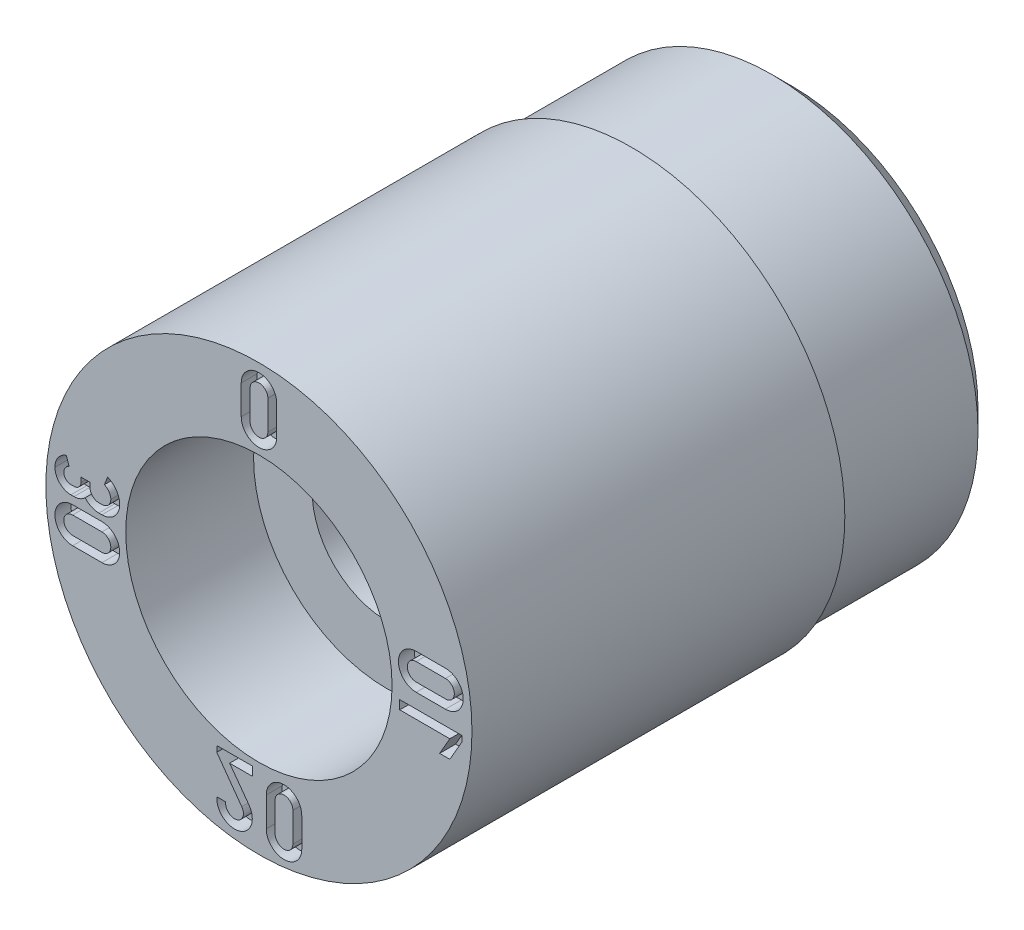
ISO-10303-21;
HEADER;
FILE_DESCRIPTION(('STEP AP214'),'2;1');
FILE_NAME('part.step','',(''),(''),'','','');
FILE_SCHEMA(('AUTOMOTIVE_DESIGN { 1 0 10303 214 1 1 1 1 }'));
ENDSEC;
DATA;
#1=APPLICATION_CONTEXT('core data for automotive mechanical design processes');
#2=APPLICATION_PROTOCOL_DEFINITION('international standard','automotive_design',2000,#1);
#3=PRODUCT_CONTEXT('',#1,'mechanical');
#4=PRODUCT('Part','Part','',(#3));
#5=PRODUCT_RELATED_PRODUCT_CATEGORY('part','',(#4));
#6=PRODUCT_DEFINITION_FORMATION('','',#4);
#7=PRODUCT_DEFINITION_CONTEXT('part definition',#1,'design');
#8=PRODUCT_DEFINITION('design','',#6,#7);
#9=PRODUCT_DEFINITION_SHAPE('','',#8);
#10=(LENGTH_UNIT() NAMED_UNIT(*) SI_UNIT(.MILLI.,.METRE.));
#11=(NAMED_UNIT(*) PLANE_ANGLE_UNIT() SI_UNIT($,.RADIAN.));
#12=(NAMED_UNIT(*) SI_UNIT($,.STERADIAN.) SOLID_ANGLE_UNIT());
#13=UNCERTAINTY_MEASURE_WITH_UNIT(LENGTH_MEASURE(1.E-05),#10,'distance_accuracy_value','');
#14=(GEOMETRIC_REPRESENTATION_CONTEXT(3) GLOBAL_UNCERTAINTY_ASSIGNED_CONTEXT((#13)) GLOBAL_UNIT_ASSIGNED_CONTEXT((#10,
#11,#12)) REPRESENTATION_CONTEXT('',''));
#15=CARTESIAN_POINT('',(0.,0.,0.));
#16=DIRECTION('',(0.,0.,1.));
#17=DIRECTION('',(1.,0.,0.));
#18=AXIS2_PLACEMENT_3D('',#15,#16,#17);
#19=CARTESIAN_POINT('',(0.,0.,3.79790950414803));
#20=DIRECTION('',(0.,0.,1.));
#21=DIRECTION('',(1.,0.,0.));
#22=AXIS2_PLACEMENT_3D('',#19,#20,#21);
#23=CYLINDRICAL_SURFACE('',#22,2.);
#24=CARTESIAN_POINT('',(0.,0.,0.));
#25=DIRECTION('',(0.,0.,1.));
#26=DIRECTION('',(1.,0.,0.));
#27=AXIS2_PLACEMENT_3D('',#24,#25,#26);
#28=CIRCLE('',#27,2.);
#29=CARTESIAN_POINT('',(2.,0.,0.));
#30=VERTEX_POINT('',#29);
#31=EDGE_CURVE('E11',#30,#30,#28,.T.);
#32=ORIENTED_EDGE('',*,*,#31,.F.);
#33=EDGE_LOOP('',(#32));
#34=FACE_BOUND('',#33,.T.);
#35=CARTESIAN_POINT('',(0.,0.,-3.5));
#36=DIRECTION('',(0.,0.,-1.));
#37=DIRECTION('',(-1.,0.,0.));
#38=AXIS2_PLACEMENT_3D('',#35,#36,#37);
#39=CIRCLE('',#38,2.);
#40=CARTESIAN_POINT('',(-2.,0.,-3.5));
#41=VERTEX_POINT('',#40);
#42=EDGE_CURVE('E37',#41,#41,#39,.T.);
#43=ORIENTED_EDGE('',*,*,#42,.F.);
#44=EDGE_LOOP('',(#43));
#45=FACE_BOUND('',#44,.T.);
#46=ADVANCED_FACE('F34',(#34,#45),#23,.T.);
#47=CARTESIAN_POINT('',(0.,0.,-5.));
#48=DIRECTION('',(0.,0.,1.));
#49=DIRECTION('',(1.,0.,0.));
#50=AXIS2_PLACEMENT_3D('',#47,#48,#49);
#51=CONICAL_SURFACE('',#50,1.7499999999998,0.785398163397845);
#52=CARTESIAN_POINT('',(0.,0.,-5.));
#53=DIRECTION('',(0.,0.,1.));
#54=DIRECTION('',(1.,0.,0.));
#55=AXIS2_PLACEMENT_3D('',#52,#53,#54);
#56=CIRCLE('',#55,1.7499999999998);
#57=CARTESIAN_POINT('',(1.7499999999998,0.,-5.));
#58=VERTEX_POINT('',#57);
#59=EDGE_CURVE('E1032',#58,#58,#56,.T.);
#60=ORIENTED_EDGE('',*,*,#59,.T.);
#61=EDGE_LOOP('',(#60));
#62=FACE_BOUND('',#61,.T.);
#63=CARTESIAN_POINT('',(0.,0.,-4.81499999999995));
#64=DIRECTION('',(0.,0.,1.));
#65=DIRECTION('',(1.,0.,0.));
#66=AXIS2_PLACEMENT_3D('',#63,#64,#65);
#67=CIRCLE('',#66,1.935);
#68=CARTESIAN_POINT('',(1.935,0.,-4.81499999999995));
#69=VERTEX_POINT('',#68);
#70=EDGE_CURVE('E1031',#69,#69,#67,.T.);
#71=ORIENTED_EDGE('',*,*,#70,.F.);
#72=EDGE_LOOP('',(#71));
#73=FACE_BOUND('',#72,.T.);
#74=ADVANCED_FACE('F1054',(#62,#73),#51,.T.);
#75=CARTESIAN_POINT('',(0.,2.,0.));
#76=DIRECTION('',(0.,0.,-1.));
#77=DIRECTION('',(-1.,0.,0.));
#78=AXIS2_PLACEMENT_3D('',#75,#76,#77);
#79=PLANE('',#78);
#80=DIRECTION('',(8.53203783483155E-05,0.999999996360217,0.));
#81=VECTOR('',#80,1.);
#82=CARTESIAN_POINT('',(0.402231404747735,-1.75504459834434,0.));
#83=LINE('',#82,#81);
#84=CARTESIAN_POINT('',(0.402231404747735,-1.75504459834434,0.));
#85=VERTEX_POINT('',#84);
#86=CARTESIAN_POINT('',(0.402254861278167,-1.48012164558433,0.));
#87=VERTEX_POINT('',#86);
#88=EDGE_CURVE('E522',#85,#87,#83,.T.);
#89=ORIENTED_EDGE('',*,*,#88,.F.);
#90=CARTESIAN_POINT('',(0.23561392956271,-1.75505865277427,0.));
#91=DIRECTION('',(0.,0.,1.));
#92=DIRECTION('',(1.,0.,0.));
#93=AXIS2_PLACEMENT_3D('',#90,#91,#92);
#94=CIRCLE('',#93,0.166617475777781);
#95=CARTESIAN_POINT('',(0.0689964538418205,-1.75506300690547,0.));
#96=VERTEX_POINT('',#95);
#97=EDGE_CURVE('E50',#96,#85,#94,.T.);
#98=ORIENTED_EDGE('',*,*,#97,.F.);
#99=DIRECTION('',(8.43514760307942E-05,-0.999999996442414,0.));
#100=VECTOR('',#99,1.);
#101=CARTESIAN_POINT('',(0.0689732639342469,-1.4801430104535,0.));
#102=LINE('',#101,#100);
#103=CARTESIAN_POINT('',(0.0689732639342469,-1.4801430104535,0.));
#104=VERTEX_POINT('',#103);
#105=EDGE_CURVE('E511',#104,#96,#102,.T.);
#106=ORIENTED_EDGE('',*,*,#105,.F.);
#107=CARTESIAN_POINT('',(0.235614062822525,-1.48013570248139,0.));
#108=DIRECTION('',(0.,0.,1.));
#109=DIRECTION('',(1.,0.,0.));
#110=AXIS2_PLACEMENT_3D('',#107,#108,#109);
#111=CIRCLE('',#110,0.166640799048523);
#112=EDGE_CURVE('E525',#87,#104,#111,.T.);
#113=ORIENTED_EDGE('',*,*,#112,.F.);
#114=EDGE_LOOP('',(#89,#98,#106,#113));
#115=FACE_BOUND('',#114,.T.);
#116=DIRECTION('',(-0.999999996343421,8.55170029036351E-05,0.));
#117=VECTOR('',#116,1.);
#118=CARTESIAN_POINT('',(-1.47336169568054,0.109387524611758,0.));
#119=LINE('',#118,#117);
#120=CARTESIAN_POINT('',(-1.47336169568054,0.109387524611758,0.));
#121=VERTEX_POINT('',#120);
#122=CARTESIAN_POINT('',(-1.50251990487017,0.109390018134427,0.));
#123=VERTEX_POINT('',#122);
#124=EDGE_CURVE('E604',#121,#123,#119,.T.);
#125=ORIENTED_EDGE('',*,*,#124,.F.);
#126=CARTESIAN_POINT('',(-1.47335457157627,0.192693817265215,0.));
#127=DIRECTION('',(0.,0.,-1.));
#128=DIRECTION('',(1.,0.,0.));
#129=AXIS2_PLACEMENT_3D('',#126,#127,#128);
#130=CIRCLE('',#129,0.0833062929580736);
#131=CARTESIAN_POINT('',(-1.39004827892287,0.19268669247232,0.));
#132=VERTEX_POINT('',#131);
#133=EDGE_CURVE('E532',#132,#121,#130,.T.);
#134=ORIENTED_EDGE('',*,*,#133,.F.);
#135=CARTESIAN_POINT('',(-1.48587021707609,0.192694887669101,0.));
#136=DIRECTION('',(0.,0.,-1.));
#137=DIRECTION('',(1.,0.,0.));
#138=AXIS2_PLACEMENT_3D('',#135,#136,#137);
#139=CIRCLE('',#138,0.0958219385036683);
#140=CARTESIAN_POINT('',(-1.45069278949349,0.281826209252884,0.));
#141=VERTEX_POINT('',#140);
#142=EDGE_CURVE('E542',#141,#132,#139,.T.);
#143=ORIENTED_EDGE('',*,*,#142,.F.);
#144=DIRECTION('',(-0.367087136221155,-0.930186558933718,0.));
#145=VECTOR('',#144,1.);
#146=CARTESIAN_POINT('',(-1.42011938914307,0.359298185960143,0.));
#147=LINE('',#146,#145);
#148=CARTESIAN_POINT('',(-1.42011938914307,0.359298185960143,0.));
#149=VERTEX_POINT('',#148);
#150=EDGE_CURVE('E658',#149,#141,#147,.T.);
#151=ORIENTED_EDGE('',*,*,#150,.F.);
#152=CARTESIAN_POINT('',(-1.48591105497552,0.192655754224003,0.));
#153=DIRECTION('',(0.,0.,1.));
#154=DIRECTION('',(1.,0.,0.));
#155=AXIS2_PLACEMENT_3D('',#152,#153,#154);
#156=CIRCLE('',#155,0.17915982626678);
#157=CARTESIAN_POINT('',(-1.30675122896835,0.192665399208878,0.));
#158=VERTEX_POINT('',#157);
#159=EDGE_CURVE('E655',#158,#149,#156,.T.);
#160=ORIENTED_EDGE('',*,*,#159,.F.);
#161=CARTESIAN_POINT('',(-1.47334052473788,0.192656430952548,0.));
#162=DIRECTION('',(0.,0.,1.));
#163=DIRECTION('',(1.,0.,0.));
#164=AXIS2_PLACEMENT_3D('',#161,#162,#163);
#165=CIRCLE('',#164,0.166589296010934);
#166=CARTESIAN_POINT('',(-1.47335472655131,0.0260671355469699,0.));
#167=VERTEX_POINT('',#166);
#168=EDGE_CURVE('E652',#167,#158,#165,.T.);
#169=ORIENTED_EDGE('',*,*,#168,.F.);
#170=DIRECTION('',(0.99999999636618,-8.52504561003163E-05,0.));
#171=VECTOR('',#170,1.);
#172=CARTESIAN_POINT('',(-1.50252361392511,0.0260696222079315,0.));
#173=LINE('',#172,#171);
#174=CARTESIAN_POINT('',(-1.50252361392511,0.0260696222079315,0.));
#175=VERTEX_POINT('',#174);
#176=EDGE_CURVE('E649',#175,#167,#173,.T.);
#177=ORIENTED_EDGE('',*,*,#176,.F.);
#178=CARTESIAN_POINT('',(-1.50254948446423,0.19261711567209,0.));
#179=DIRECTION('',(0.,0.,1.));
#180=DIRECTION('',(1.,0.,0.));
#181=AXIS2_PLACEMENT_3D('',#178,#179,#180);
#182=CIRCLE('',#181,0.166547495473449);
#183=CARTESIAN_POINT('',(-1.63046460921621,0.0859597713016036,0.));
#184=VERTEX_POINT('',#183);
#185=EDGE_CURVE('E646',#184,#175,#182,.T.);
#186=ORIENTED_EDGE('',*,*,#185,.F.);
#187=CARTESIAN_POINT('',(-1.73576257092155,0.192635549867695,0.));
#188=DIRECTION('',(0.,0.,1.));
#189=DIRECTION('',(1.,0.,0.));
#190=AXIS2_PLACEMENT_3D('',#187,#188,#189);
#191=CIRCLE('',#190,0.149891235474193);
#192=CARTESIAN_POINT('',(-1.73577544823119,0.0427443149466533,0.));
#193=VERTEX_POINT('',#192);
#194=EDGE_CURVE('E643',#193,#184,#191,.T.);
#195=ORIENTED_EDGE('',*,*,#194,.F.);
#196=DIRECTION('',(0.999999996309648,-8.59110264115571E-05,0.));
#197=VECTOR('',#196,1.);
#198=CARTESIAN_POINT('',(-1.76492133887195,0.0427468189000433,0.));
#199=LINE('',#198,#197);
#200=CARTESIAN_POINT('',(-1.76492133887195,0.0427468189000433,0.));
#201=VERTEX_POINT('',#200);
#202=EDGE_CURVE('E640',#201,#193,#199,.T.);
#203=ORIENTED_EDGE('',*,*,#202,.F.);
#204=CARTESIAN_POINT('',(-1.76493167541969,0.1926880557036,0.));
#205=DIRECTION('',(0.,0.,1.));
#206=DIRECTION('',(1.,0.,0.));
#207=AXIS2_PLACEMENT_3D('',#204,#205,#206);
#208=CIRCLE('',#207,0.149941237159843);
#209=CARTESIAN_POINT('',(-1.91487290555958,0.192733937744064,0.));
#210=VERTEX_POINT('',#209);
#211=EDGE_CURVE('E637',#210,#201,#208,.T.);
#212=ORIENTED_EDGE('',*,*,#211,.F.);
#213=CARTESIAN_POINT('',(-1.75654607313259,0.192685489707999,0.));
#214=DIRECTION('',(0.,0.,1.));
#215=DIRECTION('',(1.,0.,0.));
#216=AXIS2_PLACEMENT_3D('',#213,#214,#215);
#217=CIRCLE('',#216,0.158326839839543);
#218=CARTESIAN_POINT('',(-1.80724392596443,0.342675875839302,0.));
#219=VERTEX_POINT('',#218);
#220=EDGE_CURVE('E634',#219,#210,#217,.T.);
#221=ORIENTED_EDGE('',*,*,#220,.F.);
#222=DIRECTION('',(-0.319923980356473,0.947443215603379,0.));
#223=VECTOR('',#222,1.);
#224=CARTESIAN_POINT('',(-1.78058873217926,0.263737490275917,0.));
#225=LINE('',#224,#223);
#226=CARTESIAN_POINT('',(-1.78058873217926,0.263737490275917,0.));
#227=VERTEX_POINT('',#226);
#228=EDGE_CURVE('E631',#227,#219,#225,.T.);
#229=ORIENTED_EDGE('',*,*,#228,.F.);
#230=CARTESIAN_POINT('',(-1.75668602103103,0.192778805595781,0.));
#231=DIRECTION('',(0.,0.,-1.));
#232=DIRECTION('',(1.,0.,0.));
#233=AXIS2_PLACEMENT_3D('',#230,#231,#232);
#234=CIRCLE('',#233,0.074876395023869);
#235=CARTESIAN_POINT('',(-1.83156238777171,0.192713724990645,0.));
#236=VERTEX_POINT('',#235);
#237=EDGE_CURVE('E628',#236,#227,#234,.T.);
#238=ORIENTED_EDGE('',*,*,#237,.F.);
#239=CARTESIAN_POINT('',(-1.76485789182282,0.192771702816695,0.));
#240=DIRECTION('',(0.,0.,-1.));
#241=DIRECTION('',(1.,0.,0.));
#242=AXIS2_PLACEMENT_3D('',#239,#240,#241);
#243=CIRCLE('',#242,0.0667045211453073);
#244=CARTESIAN_POINT('',(-1.76492249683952,0.126067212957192,0.));
#245=VERTEX_POINT('',#244);
#246=EDGE_CURVE('E625',#245,#236,#243,.T.);
#247=ORIENTED_EDGE('',*,*,#246,.F.);
#248=DIRECTION('',(-0.999999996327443,8.57036442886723E-05,0.));
#249=VECTOR('',#248,1.);
#250=CARTESIAN_POINT('',(-1.73576832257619,0.126064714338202,0.));
#251=LINE('',#250,#249);
#252=CARTESIAN_POINT('',(-1.73576832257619,0.126064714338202,0.));
#253=VERTEX_POINT('',#252);
#254=EDGE_CURVE('E622',#253,#245,#251,.T.);
#255=ORIENTED_EDGE('',*,*,#254,.F.);
#256=CARTESIAN_POINT('',(-1.73576261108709,0.192707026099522,0.));
#257=DIRECTION('',(0.,0.,-1.));
#258=DIRECTION('',(1.,0.,0.));
#259=AXIS2_PLACEMENT_3D('',#256,#257,#258);
#260=CIRCLE('',#259,0.0666423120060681);
#261=CARTESIAN_POINT('',(-1.66912029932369,0.192701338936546,0.));
#262=VERTEX_POINT('',#261);
#263=EDGE_CURVE('E619',#262,#253,#260,.T.);
#264=ORIENTED_EDGE('',*,*,#263,.F.);
#265=DIRECTION('',(-8.55211335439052E-05,-0.999999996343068,0.));
#266=VECTOR('',#265,1.);
#267=CARTESIAN_POINT('',(-1.66911673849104,0.234338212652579,0.));
#268=LINE('',#267,#266);
#269=CARTESIAN_POINT('',(-1.66911673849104,0.234338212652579,0.));
#270=VERTEX_POINT('',#269);
#271=EDGE_CURVE('E616',#270,#262,#268,.T.);
#272=ORIENTED_EDGE('',*,*,#271,.F.);
#273=DIRECTION('',(-0.999999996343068,8.55211333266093E-05,0.));
#274=VECTOR('',#273,1.);
#275=CARTESIAN_POINT('',(-1.58579633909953,0.234331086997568,0.));
#276=LINE('',#275,#274);
#277=CARTESIAN_POINT('',(-1.58579633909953,0.234331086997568,0.));
#278=VERTEX_POINT('',#277);
#279=EDGE_CURVE('E613',#278,#270,#276,.T.);
#280=ORIENTED_EDGE('',*,*,#279,.F.);
#281=DIRECTION('',(8.54959130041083E-05,0.999999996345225,0.));
#282=VECTOR('',#281,1.);
#283=CARTESIAN_POINT('',(-1.58579989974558,0.192684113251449,0.));
#284=LINE('',#283,#282);
#285=CARTESIAN_POINT('',(-1.58579989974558,0.192684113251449,0.));
#286=VERTEX_POINT('',#285);
#287=EDGE_CURVE('E610',#286,#278,#284,.T.);
#288=ORIENTED_EDGE('',*,*,#287,.F.);
#289=CARTESIAN_POINT('',(-1.50251292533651,0.192676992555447,0.));
#290=DIRECTION('',(0.,0.,-1.));
#291=DIRECTION('',(1.,0.,0.));
#292=AXIS2_PLACEMENT_3D('',#289,#290,#291);
#293=CIRCLE('',#292,0.0832869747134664);
#294=EDGE_CURVE('E607',#123,#286,#293,.T.);
#295=ORIENTED_EDGE('',*,*,#294,.F.);
#296=EDGE_LOOP('',(#125,#134,#143,#151,#160,#169,#177,#186,#195,#203,#212,#221,#229,#238,#247,
#255,#264,#272,#280,#288,#295));
#297=FACE_BOUND('',#296,.T.);
#298=DIRECTION('',(-0.999999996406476,8.47764585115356E-05,0.));
#299=VECTOR('',#298,1.);
#300=CARTESIAN_POINT('',(1.75116252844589,0.391323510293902,0.));
#301=LINE('',#300,#299);
#302=CARTESIAN_POINT('',(1.75116252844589,0.391323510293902,0.));
#303=VERTEX_POINT('',#302);
#304=CARTESIAN_POINT('',(1.47624927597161,0.391346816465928,0.));
#305=VERTEX_POINT('',#304);
#306=EDGE_CURVE('E754',#303,#305,#301,.T.);
#307=ORIENTED_EDGE('',*,*,#306,.F.);
#308=CARTESIAN_POINT('',(1.75117667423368,0.224706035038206,0.));
#309=DIRECTION('',(0.,0.,1.));
#310=DIRECTION('',(1.,0.,0.));
#311=AXIS2_PLACEMENT_3D('',#308,#309,#310);
#312=CIRCLE('',#311,0.166617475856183);
#313=CARTESIAN_POINT('',(1.75119082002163,0.0580885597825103,0.));
#314=VERTEX_POINT('',#313);
#315=EDGE_CURVE('E732',#314,#303,#312,.T.);
#316=ORIENTED_EDGE('',*,*,#315,.F.);
#317=DIRECTION('',(0.999999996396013,8.48997850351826E-05,0.));
#318=VECTOR('',#317,1.);
#319=CARTESIAN_POINT('',(1.47627082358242,0.0580652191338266,0.));
#320=LINE('',#319,#318);
#321=CARTESIAN_POINT('',(1.47627082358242,0.0580652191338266,0.));
#322=VERTEX_POINT('',#321);
#323=EDGE_CURVE('E743',#322,#314,#320,.T.);
#324=ORIENTED_EDGE('',*,*,#323,.F.);
#325=CARTESIAN_POINT('',(1.47625077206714,0.224706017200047,0.));
#326=DIRECTION('',(0.,0.,1.));
#327=DIRECTION('',(1.,0.,0.));
#328=AXIS2_PLACEMENT_3D('',#325,#326,#327);
#329=CIRCLE('',#328,0.166640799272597);
#330=EDGE_CURVE('E757',#305,#322,#329,.T.);
#331=ORIENTED_EDGE('',*,*,#330,.F.);
#332=EDGE_LOOP('',(#307,#316,#324,#331));
#333=FACE_BOUND('',#332,.T.);
#334=DIRECTION('',(8.48997847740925E-05,-0.999999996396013,0.));
#335=VECTOR('',#334,1.);
#336=CARTESIAN_POINT('',(1.32158770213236,-0.161800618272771,0.));
#337=LINE('',#336,#335);
#338=CARTESIAN_POINT('',(1.32158063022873,-0.0785035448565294,0.));
#339=VERTEX_POINT('',#338);
#340=CARTESIAN_POINT('',(1.32158770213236,-0.161800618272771,0.));
#341=VERTEX_POINT('',#340);
#342=EDGE_CURVE('E795',#339,#341,#337,.T.);
#343=ORIENTED_EDGE('',*,*,#342,.F.);
#344=DIRECTION('',(-0.999999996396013,-8.48997846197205E-05,0.));
#345=VECTOR('',#344,1.);
#346=CARTESIAN_POINT('',(1.32158063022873,-0.0785035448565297,0.));
#347=LINE('',#346,#345);
#348=CARTESIAN_POINT('',(1.90473012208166,-0.0784540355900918,0.));
#349=VERTEX_POINT('',#348);
#350=EDGE_CURVE('E764',#349,#339,#347,.T.);
#351=ORIENTED_EDGE('',*,*,#350,.F.);
#352=DIRECTION('',(-8.4899782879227E-05,0.999999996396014,0.));
#353=VECTOR('',#352,1.);
#354=CARTESIAN_POINT('',(1.90473012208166,-0.0784540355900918,0.));
#355=LINE('',#354,#353);
#356=CARTESIAN_POINT('',(1.90473477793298,-0.133293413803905,0.));
#357=VERTEX_POINT('',#356);
#358=EDGE_CURVE('E775',#357,#349,#355,.T.);
#359=ORIENTED_EDGE('',*,*,#358,.F.);
#360=DIRECTION('',(0.498418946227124,0.866936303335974,0.));
#361=VECTOR('',#360,1.);
#362=CARTESIAN_POINT('',(1.90473477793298,-0.133293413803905,0.));
#363=LINE('',#362,#361);
#364=CARTESIAN_POINT('',(1.79257670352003,-0.328378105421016,0.));
#365=VERTEX_POINT('',#364);
#366=EDGE_CURVE('E807',#365,#357,#363,.T.);
#367=ORIENTED_EDGE('',*,*,#366,.F.);
#368=DIRECTION('',(0.999999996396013,8.48997838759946E-05,0.));
#369=VECTOR('',#368,1.);
#370=CARTESIAN_POINT('',(1.79257670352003,-0.328378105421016,0.));
#371=LINE('',#370,#369);
#372=CARTESIAN_POINT('',(1.69649699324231,-0.328386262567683,0.));
#373=VERTEX_POINT('',#372);
#374=EDGE_CURVE('E804',#373,#365,#371,.T.);
#375=ORIENTED_EDGE('',*,*,#374,.F.);
#376=DIRECTION('',(-0.498285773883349,-0.867012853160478,0.));
#377=VECTOR('',#376,1.);
#378=CARTESIAN_POINT('',(1.69649699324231,-0.328386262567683,0.));
#379=LINE('',#378,#377);
#380=CARTESIAN_POINT('',(1.79225931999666,-0.161760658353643,0.));
#381=VERTEX_POINT('',#380);
#382=EDGE_CURVE('E801',#381,#373,#379,.T.);
#383=ORIENTED_EDGE('',*,*,#382,.F.);
#384=DIRECTION('',(0.999999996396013,8.4899784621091E-05,0.));
#385=VECTOR('',#384,1.);
#386=CARTESIAN_POINT('',(1.79225931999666,-0.161760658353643,0.));
#387=LINE('',#386,#385);
#388=EDGE_CURVE('E798',#341,#381,#387,.T.);
#389=ORIENTED_EDGE('',*,*,#388,.F.);
#390=EDGE_LOOP('',(#343,#351,#359,#367,#375,#383,#389));
#391=FACE_BOUND('',#390,.T.);
#392=DIRECTION('',(-8.43514763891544E-05,0.999999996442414,0.));
#393=VECTOR('',#392,1.);
#394=CARTESIAN_POINT('',(-0.0621675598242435,-1.39356439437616,0.));
#395=LINE('',#394,#393);
#396=CARTESIAN_POINT('',(-0.0621675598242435,-1.39356439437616,0.));
#397=VERTEX_POINT('',#396);
#398=CARTESIAN_POINT('',(-0.0621745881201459,-1.3102428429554,0.));
#399=VERTEX_POINT('',#398);
#400=EDGE_CURVE('E857',#397,#399,#395,.T.);
#401=ORIENTED_EDGE('',*,*,#400,.F.);
#402=DIRECTION('',(0.999999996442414,8.43514759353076E-05,0.));
#403=VECTOR('',#402,1.);
#404=CARTESIAN_POINT('',(-0.274620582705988,-1.39358231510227,0.));
#405=LINE('',#404,#403);
#406=CARTESIAN_POINT('',(-0.274620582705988,-1.39358231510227,0.));
#407=VERTEX_POINT('',#406);
#408=EDGE_CURVE('E814',#407,#397,#405,.T.);
#409=ORIENTED_EDGE('',*,*,#408,.F.);
#410=DIRECTION('',(-0.589622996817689,0.807678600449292,0.));
#411=VECTOR('',#410,1.);
#412=CARTESIAN_POINT('',(-0.0934102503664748,-1.64180822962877,0.));
#413=LINE('',#412,#411);
#414=CARTESIAN_POINT('',(-0.0934102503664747,-1.64180822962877,0.));
#415=VERTEX_POINT('',#414);
#416=EDGE_CURVE('E831',#415,#407,#413,.T.);
#417=ORIENTED_EDGE('',*,*,#416,.F.);
#418=CARTESIAN_POINT('',(-0.228684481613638,-1.73919846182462,0.));
#419=DIRECTION('',(0.,0.,1.));
#420=DIRECTION('',(1.,0.,0.));
#421=AXIS2_PLACEMENT_3D('',#418,#419,#420);
#422=CIRCLE('',#421,0.166685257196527);
#423=CARTESIAN_POINT('',(-0.394908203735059,-1.72680293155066,0.));
#424=VERTEX_POINT('',#423);
#425=EDGE_CURVE('E875',#424,#415,#422,.T.);
#426=ORIENTED_EDGE('',*,*,#425,.F.);
#427=DIRECTION('',(-0.999999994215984,-0.00010755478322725,0.));
#428=VECTOR('',#427,1.);
#429=CARTESIAN_POINT('',(-0.311114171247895,-1.72679391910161,0.));
#430=LINE('',#429,#428);
#431=CARTESIAN_POINT('',(-0.311114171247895,-1.72679391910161,0.));
#432=VERTEX_POINT('',#431);
#433=EDGE_CURVE('E872',#432,#424,#430,.T.);
#434=ORIENTED_EDGE('',*,*,#433,.F.);
#435=CARTESIAN_POINT('',(-0.228726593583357,-1.73928991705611,0.));
#436=DIRECTION('',(0.,0.,-1.));
#437=DIRECTION('',(1.,0.,0.));
#438=AXIS2_PLACEMENT_3D('',#435,#436,#437);
#439=CIRCLE('',#438,0.083329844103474);
#440=CARTESIAN_POINT('',(-0.161114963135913,-1.69058129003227,0.));
#441=VERTEX_POINT('',#440);
#442=EDGE_CURVE('E869',#441,#432,#439,.T.);
#443=ORIENTED_EDGE('',*,*,#442,.F.);
#444=DIRECTION('',(0.58452799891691,-0.811373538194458,0.));
#445=VECTOR('',#444,1.);
#446=CARTESIAN_POINT('',(-0.39540521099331,-1.36536691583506,0.));
#447=LINE('',#446,#445);
#448=CARTESIAN_POINT('',(-0.39540521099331,-1.36536691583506,0.));
#449=VERTEX_POINT('',#448);
#450=EDGE_CURVE('E866',#449,#441,#447,.T.);
#451=ORIENTED_EDGE('',*,*,#450,.F.);
#452=DIRECTION('',(8.4351474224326E-05,-0.999999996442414,0.));
#453=VECTOR('',#452,1.);
#454=CARTESIAN_POINT('',(-0.395409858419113,-1.31027095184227,0.));
#455=LINE('',#454,#453);
#456=CARTESIAN_POINT('',(-0.395409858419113,-1.31027095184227,0.));
#457=VERTEX_POINT('',#456);
#458=EDGE_CURVE('E863',#457,#449,#455,.T.);
#459=ORIENTED_EDGE('',*,*,#458,.F.);
#460=DIRECTION('',(-0.999999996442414,-8.43514755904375E-05,0.));
#461=VECTOR('',#460,1.);
#462=CARTESIAN_POINT('',(-0.0621745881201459,-1.3102428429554,0.));
#463=LINE('',#462,#461);
#464=EDGE_CURVE('E860',#399,#457,#463,.T.);
#465=ORIENTED_EDGE('',*,*,#464,.F.);
#466=EDGE_LOOP('',(#401,#409,#417,#426,#434,#443,#451,#459,#465));
#467=FACE_BOUND('',#466,.T.);
#468=DIRECTION('',(8.43544746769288E-05,-0.999999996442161,0.));
#469=VECTOR('',#468,1.);
#470=CARTESIAN_POINT('',(-0.165929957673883,1.75219415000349,0.));
#471=LINE('',#470,#469);
#472=CARTESIAN_POINT('',(-0.165929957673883,1.75219415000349,0.));
#473=VERTEX_POINT('',#472);
#474=CARTESIAN_POINT('',(-0.165906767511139,1.47728090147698,0.));
#475=VERTEX_POINT('',#474);
#476=EDGE_CURVE('E947',#473,#475,#471,.T.);
#477=ORIENTED_EDGE('',*,*,#476,.F.);
#478=CARTESIAN_POINT('',(0.000734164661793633,1.75220820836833,0.));
#479=DIRECTION('',(0.,0.,1.));
#480=DIRECTION('',(1.,0.,0.));
#481=AXIS2_PLACEMENT_3D('',#478,#479,#480);
#482=CIRCLE('',#481,0.166664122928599);
#483=CARTESIAN_POINT('',(0.16739828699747,1.75222226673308,0.));
#484=VERTEX_POINT('',#483);
#485=EDGE_CURVE('E925',#484,#473,#482,.T.);
#486=ORIENTED_EDGE('',*,*,#485,.F.);
#487=DIRECTION('',(8.53236016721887E-05,0.999999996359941,0.));
#488=VECTOR('',#487,1.);
#489=CARTESIAN_POINT('',(0.16737482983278,1.47730226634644,0.));
#490=LINE('',#489,#488);
#491=CARTESIAN_POINT('',(0.16737482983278,1.47730226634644,0.));
#492=VERTEX_POINT('',#491);
#493=EDGE_CURVE('E936',#492,#484,#490,.T.);
#494=ORIENTED_EDGE('',*,*,#493,.F.);
#495=CARTESIAN_POINT('',(0.000734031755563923,1.47728230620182,0.));
#496=DIRECTION('',(0.,0.,1.));
#497=DIRECTION('',(1.,0.,0.));
#498=AXIS2_PLACEMENT_3D('',#495,#496,#497);
#499=CIRCLE('',#498,0.166640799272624);
#500=EDGE_CURVE('E950',#475,#492,#499,.T.);
#501=ORIENTED_EDGE('',*,*,#500,.F.);
#502=EDGE_LOOP('',(#477,#486,#494,#501));
#503=FACE_BOUND('',#502,.T.);
#504=DIRECTION('',(0.999999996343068,-8.55211335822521E-05,0.));
#505=VECTOR('',#504,1.);
#506=CARTESIAN_POINT('',(-1.47358512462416,-0.362852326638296,0.));
#507=LINE('',#506,#505);
#508=CARTESIAN_POINT('',(-1.74850512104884,-0.362828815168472,0.));
#509=VERTEX_POINT('',#508);
#510=CARTESIAN_POINT('',(-1.47358512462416,-0.362852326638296,0.));
#511=VERTEX_POINT('',#510);
#512=EDGE_CURVE('E1012',#509,#511,#507,.T.);
#513=ORIENTED_EDGE('',*,*,#512,.F.);
#514=CARTESIAN_POINT('',(-1.74849086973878,-0.196188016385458,0.));
#515=DIRECTION('',(0.,0.,1.));
#516=DIRECTION('',(1.,0.,0.));
#517=AXIS2_PLACEMENT_3D('',#514,#515,#516);
#518=CIRCLE('',#517,0.166640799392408);
#519=CARTESIAN_POINT('',(-1.74847661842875,-0.0295472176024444,0.));
#520=VERTEX_POINT('',#519);
#521=EDGE_CURVE('E990',#520,#509,#518,.T.);
#522=ORIENTED_EDGE('',*,*,#521,.F.);
#523=DIRECTION('',(-0.999999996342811,8.55241324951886E-05,0.));
#524=VECTOR('',#523,1.);
#525=CARTESIAN_POINT('',(-1.74847661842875,-0.0295472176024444,0.));
#526=LINE('',#525,#524);
#527=CARTESIAN_POINT('',(-1.47356336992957,-0.0295707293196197,0.));
#528=VERTEX_POINT('',#527);
#529=EDGE_CURVE('E1001',#528,#520,#526,.T.);
#530=ORIENTED_EDGE('',*,*,#529,.F.);
#531=CARTESIAN_POINT('',(-1.47357424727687,-0.196211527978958,0.));
#532=DIRECTION('',(0.,0.,1.));
#533=DIRECTION('',(1.,0.,0.));
#534=AXIS2_PLACEMENT_3D('',#531,#532,#533);
#535=CIRCLE('',#534,0.166640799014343);
#536=EDGE_CURVE('E1015',#511,#528,#535,.T.);
#537=ORIENTED_EDGE('',*,*,#536,.F.);
#538=EDGE_LOOP('',(#513,#522,#530,#537));
#539=FACE_BOUND('',#538,.T.);
#540=CARTESIAN_POINT('',(0.,0.,0.));
#541=DIRECTION('',(0.,0.,1.));
#542=DIRECTION('',(1.,0.,0.));
#543=AXIS2_PLACEMENT_3D('',#540,#541,#542);
#544=CIRCLE('',#543,1.25);
#545=CARTESIAN_POINT('',(1.25,0.,0.));
#546=VERTEX_POINT('',#545);
#547=EDGE_CURVE('E42',#546,#546,#544,.T.);
#548=ORIENTED_EDGE('',*,*,#547,.F.);
#549=EDGE_LOOP('',(#548));
#550=FACE_BOUND('',#549,.T.);
#551=ORIENTED_EDGE('',*,*,#31,.T.);
#552=EDGE_LOOP('',(#551));
#553=FACE_BOUND('',#552,.T.);
#554=ADVANCED_FACE('F1059',(#115,#297,#333,#391,#467,#503,#539,#550,#553),#79,.F.);
#555=CARTESIAN_POINT('',(0.,0.,3.79790950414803));
#556=DIRECTION('',(0.,0.,1.));
#557=DIRECTION('',(1.,0.,0.));
#558=AXIS2_PLACEMENT_3D('',#555,#556,#557);
#559=CYLINDRICAL_SURFACE('',#558,1.25);
#560=CARTESIAN_POINT('',(0.,0.,-1.2));
#561=DIRECTION('',(0.,0.,1.));
#562=DIRECTION('',(1.,0.,0.));
#563=AXIS2_PLACEMENT_3D('',#560,#561,#562);
#564=CIRCLE('',#563,1.25);
#565=CARTESIAN_POINT('',(1.25,0.,-1.2));
#566=VERTEX_POINT('',#565);
#567=EDGE_CURVE('E1041',#566,#566,#564,.T.);
#568=ORIENTED_EDGE('',*,*,#567,.F.);
#569=EDGE_LOOP('',(#568));
#570=FACE_BOUND('',#569,.T.);
#571=ORIENTED_EDGE('',*,*,#547,.T.);
#572=EDGE_LOOP('',(#571));
#573=FACE_BOUND('',#572,.T.);
#574=ADVANCED_FACE('F1065',(#570,#573),#559,.F.);
#575=CARTESIAN_POINT('',(0.,1.25,-1.2));
#576=DIRECTION('',(0.,0.,-1.));
#577=DIRECTION('',(-1.,0.,0.));
#578=AXIS2_PLACEMENT_3D('',#575,#576,#577);
#579=PLANE('',#578);
#580=CARTESIAN_POINT('',(0.,0.,-1.2));
#581=DIRECTION('',(0.,0.,1.));
#582=DIRECTION('',(1.,0.,0.));
#583=AXIS2_PLACEMENT_3D('',#580,#581,#582);
#584=CIRCLE('',#583,0.699999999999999);
#585=CARTESIAN_POINT('',(0.699999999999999,0.,-1.2));
#586=VERTEX_POINT('',#585);
#587=EDGE_CURVE('E1038',#586,#586,#584,.T.);
#588=ORIENTED_EDGE('',*,*,#587,.F.);
#589=EDGE_LOOP('',(#588));
#590=FACE_BOUND('',#589,.T.);
#591=ORIENTED_EDGE('',*,*,#567,.T.);
#592=EDGE_LOOP('',(#591));
#593=FACE_BOUND('',#592,.T.);
#594=ADVANCED_FACE('F1072',(#590,#593),#579,.F.);
#595=CARTESIAN_POINT('',(0.,0.,3.79790950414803));
#596=DIRECTION('',(0.,0.,1.));
#597=DIRECTION('',(1.,0.,0.));
#598=AXIS2_PLACEMENT_3D('',#595,#596,#597);
#599=CYLINDRICAL_SURFACE('',#598,0.699999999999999);
#600=CARTESIAN_POINT('',(0.,0.,-5.));
#601=DIRECTION('',(0.,0.,1.));
#602=DIRECTION('',(1.,0.,0.));
#603=AXIS2_PLACEMENT_3D('',#600,#601,#602);
#604=CIRCLE('',#603,0.699999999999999);
#605=CARTESIAN_POINT('',(0.699999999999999,0.,-5.));
#606=VERTEX_POINT('',#605);
#607=EDGE_CURVE('E1035',#606,#606,#604,.T.);
#608=ORIENTED_EDGE('',*,*,#607,.F.);
#609=EDGE_LOOP('',(#608));
#610=FACE_BOUND('',#609,.T.);
#611=ORIENTED_EDGE('',*,*,#587,.T.);
#612=EDGE_LOOP('',(#611));
#613=FACE_BOUND('',#612,.T.);
#614=ADVANCED_FACE('F1221',(#610,#613),#599,.F.);
#615=CARTESIAN_POINT('',(0.,0.699999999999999,-5.));
#616=DIRECTION('',(0.,0.,1.));
#617=DIRECTION('',(1.,0.,0.));
#618=AXIS2_PLACEMENT_3D('',#615,#616,#617);
#619=PLANE('',#618);
#620=ORIENTED_EDGE('',*,*,#59,.F.);
#621=EDGE_LOOP('',(#620));
#622=FACE_BOUND('',#621,.T.);
#623=ORIENTED_EDGE('',*,*,#607,.T.);
#624=EDGE_LOOP('',(#623));
#625=FACE_BOUND('',#624,.T.);
#626=ADVANCED_FACE('F1216',(#622,#625),#619,.F.);
#627=CARTESIAN_POINT('',(0.,1.935,-3.5));
#628=DIRECTION('',(0.,0.,-1.));
#629=DIRECTION('',(-1.,0.,0.));
#630=AXIS2_PLACEMENT_3D('',#627,#628,#629);
#631=PLANE('',#630);
#632=CARTESIAN_POINT('',(0.,0.,-3.5));
#633=DIRECTION('',(0.,0.,1.));
#634=DIRECTION('',(1.,0.,0.));
#635=AXIS2_PLACEMENT_3D('',#632,#633,#634);
#636=CIRCLE('',#635,1.935);
#637=CARTESIAN_POINT('',(1.935,0.,-3.5));
#638=VERTEX_POINT('',#637);
#639=EDGE_CURVE('E1022',#638,#638,#636,.T.);
#640=ORIENTED_EDGE('',*,*,#639,.T.);
#641=EDGE_LOOP('',(#640));
#642=FACE_BOUND('',#641,.T.);
#643=ORIENTED_EDGE('',*,*,#42,.T.);
#644=EDGE_LOOP('',(#643));
#645=FACE_BOUND('',#644,.T.);
#646=ADVANCED_FACE('F1051',(#642,#645),#631,.T.);
#647=CARTESIAN_POINT('',(0.,0.,0.));
#648=DIRECTION('',(0.,0.,1.));
#649=DIRECTION('',(1.,0.,0.));
#650=AXIS2_PLACEMENT_3D('',#647,#648,#649);
#651=CYLINDRICAL_SURFACE('',#650,1.935);
#652=ORIENTED_EDGE('',*,*,#639,.F.);
#653=EDGE_LOOP('',(#652));
#654=FACE_BOUND('',#653,.T.);
#655=ORIENTED_EDGE('',*,*,#70,.T.);
#656=EDGE_LOOP('',(#655));
#657=FACE_BOUND('',#656,.T.);
#658=ADVANCED_FACE('F1211',(#654,#657),#651,.T.);
#659=CARTESIAN_POINT('',(-1.74849086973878,-0.196188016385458,-0.15));
#660=DIRECTION('',(0.,0.,1.));
#661=DIRECTION('',(1.,0.,0.));
#662=AXIS2_PLACEMENT_3D('',#659,#660,#661);
#663=CYLINDRICAL_SURFACE('',#662,0.166640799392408);
#664=ORIENTED_EDGE('',*,*,#521,.T.);
#665=DIRECTION('',(0.,0.,1.));
#666=VECTOR('',#665,1.);
#667=CARTESIAN_POINT('',(-1.74850512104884,-0.362828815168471,-0.15));
#668=LINE('',#667,#666);
#669=CARTESIAN_POINT('',(-1.74850512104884,-0.362828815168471,-0.15));
#670=VERTEX_POINT('',#669);
#671=EDGE_CURVE('E1010',#670,#509,#668,.T.);
#672=ORIENTED_EDGE('',*,*,#671,.F.);
#673=CARTESIAN_POINT('',(-1.74849086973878,-0.196188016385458,-0.15));
#674=DIRECTION('',(0.,0.,1.));
#675=DIRECTION('',(1.,0.,0.));
#676=AXIS2_PLACEMENT_3D('',#673,#674,#675);
#677=CIRCLE('',#676,0.166640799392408);
#678=CARTESIAN_POINT('',(-1.74847661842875,-0.0295472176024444,-0.15));
#679=VERTEX_POINT('',#678);
#680=EDGE_CURVE('E997',#679,#670,#677,.T.);
#681=ORIENTED_EDGE('',*,*,#680,.F.);
#682=DIRECTION('',(0.,0.,1.));
#683=VECTOR('',#682,1.);
#684=CARTESIAN_POINT('',(-1.74847661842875,-0.0295472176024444,-0.15));
#685=LINE('',#684,#683);
#686=EDGE_CURVE('E1020',#679,#520,#685,.T.);
#687=ORIENTED_EDGE('',*,*,#686,.T.);
#688=EDGE_LOOP('',(#664,#672,#681,#687));
#689=FACE_BOUND('',#688,.T.);
#690=ADVANCED_FACE('F1183',(#689),#663,.F.);
#691=CARTESIAN_POINT('',(-1.74847661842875,-0.0295472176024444,-0.15));
#692=DIRECTION('',(8.55241324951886E-05,0.999999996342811,0.));
#693=DIRECTION('',(-0.999999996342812,8.55241324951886E-05,0.));
#694=AXIS2_PLACEMENT_3D('',#691,#692,#693);
#695=PLANE('',#694);
#696=ORIENTED_EDGE('',*,*,#529,.T.);
#697=ORIENTED_EDGE('',*,*,#686,.F.);
#698=DIRECTION('',(-0.999999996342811,8.55241324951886E-05,0.));
#699=VECTOR('',#698,1.);
#700=CARTESIAN_POINT('',(-1.74847661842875,-0.0295472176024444,-0.15));
#701=LINE('',#700,#699);
#702=CARTESIAN_POINT('',(-1.47356336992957,-0.0295707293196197,-0.15));
#703=VERTEX_POINT('',#702);
#704=EDGE_CURVE('E1007',#703,#679,#701,.T.);
#705=ORIENTED_EDGE('',*,*,#704,.F.);
#706=DIRECTION('',(0.,0.,1.));
#707=VECTOR('',#706,1.);
#708=CARTESIAN_POINT('',(-1.47356336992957,-0.0295707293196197,-0.15));
#709=LINE('',#708,#707);
#710=EDGE_CURVE('E1023',#703,#528,#709,.T.);
#711=ORIENTED_EDGE('',*,*,#710,.T.);
#712=EDGE_LOOP('',(#696,#697,#705,#711));
#713=FACE_BOUND('',#712,.T.);
#714=ADVANCED_FACE('F1186',(#713),#695,.F.);
#715=CARTESIAN_POINT('',(-1.47357424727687,-0.196211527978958,-0.15));
#716=DIRECTION('',(0.,0.,1.));
#717=DIRECTION('',(1.,0.,0.));
#718=AXIS2_PLACEMENT_3D('',#715,#716,#717);
#719=CYLINDRICAL_SURFACE('',#718,0.166640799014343);
#720=ORIENTED_EDGE('',*,*,#536,.T.);
#721=ORIENTED_EDGE('',*,*,#710,.F.);
#722=CARTESIAN_POINT('',(-1.47357424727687,-0.196211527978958,-0.15));
#723=DIRECTION('',(0.,0.,1.));
#724=DIRECTION('',(1.,0.,0.));
#725=AXIS2_PLACEMENT_3D('',#722,#723,#724);
#726=CIRCLE('',#725,0.166640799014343);
#727=CARTESIAN_POINT('',(-1.47358512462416,-0.362852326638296,-0.15));
#728=VERTEX_POINT('',#727);
#729=EDGE_CURVE('E1004',#728,#703,#726,.T.);
#730=ORIENTED_EDGE('',*,*,#729,.F.);
#731=DIRECTION('',(0.,0.,1.));
#732=VECTOR('',#731,1.);
#733=CARTESIAN_POINT('',(-1.47358512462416,-0.362852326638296,-0.15));
#734=LINE('',#733,#732);
#735=EDGE_CURVE('E1025',#728,#511,#734,.T.);
#736=ORIENTED_EDGE('',*,*,#735,.T.);
#737=EDGE_LOOP('',(#720,#721,#730,#736));
#738=FACE_BOUND('',#737,.T.);
#739=ADVANCED_FACE('F1188',(#738),#719,.F.);
#740=CARTESIAN_POINT('',(-1.47358512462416,-0.362852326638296,-0.15));
#741=DIRECTION('',(-8.55211335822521E-05,-0.999999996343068,0.));
#742=DIRECTION('',(0.999999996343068,-8.55211335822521E-05,0.));
#743=AXIS2_PLACEMENT_3D('',#740,#741,#742);
#744=PLANE('',#743);
#745=ORIENTED_EDGE('',*,*,#512,.T.);
#746=ORIENTED_EDGE('',*,*,#735,.F.);
#747=DIRECTION('',(0.999999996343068,-8.55211335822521E-05,0.));
#748=VECTOR('',#747,1.);
#749=CARTESIAN_POINT('',(-1.47358512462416,-0.362852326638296,-0.15));
#750=LINE('',#749,#748);
#751=EDGE_CURVE('E1000',#670,#728,#750,.T.);
#752=ORIENTED_EDGE('',*,*,#751,.F.);
#753=ORIENTED_EDGE('',*,*,#671,.T.);
#754=EDGE_LOOP('',(#745,#746,#752,#753));
#755=FACE_BOUND('',#754,.T.);
#756=ADVANCED_FACE('F1178',(#755),#744,.F.);
#757=CARTESIAN_POINT('',(-1.74849086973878,-0.196188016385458,-0.15));
#758=DIRECTION('',(0.,0.,1.));
#759=DIRECTION('',(1.,0.,0.));
#760=AXIS2_PLACEMENT_3D('',#757,#758,#759);
#761=PLANE('',#760);
#762=DIRECTION('',(0.99999996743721,-0.00025519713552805,0.));
#763=VECTOR('',#762,1.);
#764=CARTESIAN_POINT('',(-1.4735746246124,-0.279555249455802,-0.15));
#765=LINE('',#764,#763);
#766=CARTESIAN_POINT('',(-1.74849799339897,-0.279485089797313,-0.15));
#767=VERTEX_POINT('',#766);
#768=CARTESIAN_POINT('',(-1.4735746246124,-0.279555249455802,-0.15));
#769=VERTEX_POINT('',#768);
#770=EDGE_CURVE('E974',#767,#769,#765,.T.);
#771=ORIENTED_EDGE('',*,*,#770,.F.);
#772=CARTESIAN_POINT('',(-1.74849086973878,-0.196188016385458,-0.15));
#773=DIRECTION('',(0.,0.,1.));
#774=DIRECTION('',(1.,0.,0.));
#775=AXIS2_PLACEMENT_3D('',#772,#773,#774);
#776=CIRCLE('',#775,0.0832970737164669);
#777=CARTESIAN_POINT('',(-1.74848374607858,-0.112890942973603,-0.15));
#778=VERTEX_POINT('',#777);
#779=EDGE_CURVE('E971',#778,#767,#776,.T.);
#780=ORIENTED_EDGE('',*,*,#779,.F.);
#781=DIRECTION('',(-0.999999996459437,-8.41494282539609E-05,0.));
#782=VECTOR('',#781,1.);
#783=CARTESIAN_POINT('',(-1.74848374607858,-0.112890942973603,-0.15));
#784=LINE('',#783,#782);
#785=CARTESIAN_POINT('',(-1.4735578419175,-0.112867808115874,-0.15));
#786=VERTEX_POINT('',#785);
#787=EDGE_CURVE('E967',#786,#778,#784,.T.);
#788=ORIENTED_EDGE('',*,*,#787,.F.);
#789=CARTESIAN_POINT('',(-1.47357424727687,-0.196211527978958,-0.15));
#790=DIRECTION('',(0.,0.,1.));
#791=DIRECTION('',(1.,0.,0.));
#792=AXIS2_PLACEMENT_3D('',#789,#790,#791);
#793=CIRCLE('',#792,0.083343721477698);
#794=EDGE_CURVE('E964',#769,#786,#793,.T.);
#795=ORIENTED_EDGE('',*,*,#794,.F.);
#796=EDGE_LOOP('',(#771,#780,#788,#795));
#797=FACE_BOUND('',#796,.T.);
#798=ORIENTED_EDGE('',*,*,#680,.T.);
#799=ORIENTED_EDGE('',*,*,#751,.T.);
#800=ORIENTED_EDGE('',*,*,#729,.T.);
#801=ORIENTED_EDGE('',*,*,#704,.T.);
#802=EDGE_LOOP('',(#798,#799,#800,#801));
#803=FACE_BOUND('',#802,.T.);
#804=ADVANCED_FACE('F1190',(#797,#803),#761,.T.);
#805=CARTESIAN_POINT('',(-1.47357424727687,-0.196211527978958,-0.15));
#806=DIRECTION('',(0.,0.,1.));
#807=DIRECTION('',(1.,0.,0.));
#808=AXIS2_PLACEMENT_3D('',#805,#806,#807);
#809=CYLINDRICAL_SURFACE('',#808,0.083343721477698);
#810=CARTESIAN_POINT('',(-1.47357424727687,-0.196211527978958,0.));
#811=DIRECTION('',(0.,0.,1.));
#812=DIRECTION('',(1.,0.,0.));
#813=AXIS2_PLACEMENT_3D('',#810,#811,#812);
#814=CIRCLE('',#813,0.083343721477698);
#815=CARTESIAN_POINT('',(-1.4735746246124,-0.279555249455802,0.));
#816=VERTEX_POINT('',#815);
#817=CARTESIAN_POINT('',(-1.4735578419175,-0.112867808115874,0.));
#818=VERTEX_POINT('',#817);
#819=EDGE_CURVE('E957',#816,#818,#814,.T.);
#820=ORIENTED_EDGE('',*,*,#819,.F.);
#821=DIRECTION('',(0.,0.,1.));
#822=VECTOR('',#821,1.);
#823=CARTESIAN_POINT('',(-1.4735746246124,-0.279555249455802,-0.15));
#824=LINE('',#823,#822);
#825=EDGE_CURVE('E988',#769,#816,#824,.T.);
#826=ORIENTED_EDGE('',*,*,#825,.F.);
#827=ORIENTED_EDGE('',*,*,#794,.T.);
#828=DIRECTION('',(0.,0.,1.));
#829=VECTOR('',#828,1.);
#830=CARTESIAN_POINT('',(-1.4735578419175,-0.112867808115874,-0.15));
#831=LINE('',#830,#829);
#832=EDGE_CURVE('E977',#786,#818,#831,.T.);
#833=ORIENTED_EDGE('',*,*,#832,.T.);
#834=EDGE_LOOP('',(#820,#826,#827,#833));
#835=FACE_BOUND('',#834,.T.);
#836=ADVANCED_FACE('F1192',(#835),#809,.T.);
#837=CARTESIAN_POINT('',(-1.4735746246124,-0.279555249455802,-0.15));
#838=DIRECTION('',(-0.00025519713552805,-0.999999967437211,0.));
#839=DIRECTION('',(0.99999996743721,-0.00025519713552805,0.));
#840=AXIS2_PLACEMENT_3D('',#837,#838,#839);
#841=PLANE('',#840);
#842=DIRECTION('',(0.99999996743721,-0.00025519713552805,0.));
#843=VECTOR('',#842,1.);
#844=CARTESIAN_POINT('',(-1.4735746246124,-0.279555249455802,0.));
#845=LINE('',#844,#843);
#846=CARTESIAN_POINT('',(-1.74849799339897,-0.279485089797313,0.));
#847=VERTEX_POINT('',#846);
#848=EDGE_CURVE('E968',#847,#816,#845,.T.);
#849=ORIENTED_EDGE('',*,*,#848,.F.);
#850=DIRECTION('',(0.,0.,1.));
#851=VECTOR('',#850,1.);
#852=CARTESIAN_POINT('',(-1.74849799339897,-0.279485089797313,-0.15));
#853=LINE('',#852,#851);
#854=EDGE_CURVE('E991',#767,#847,#853,.T.);
#855=ORIENTED_EDGE('',*,*,#854,.F.);
#856=ORIENTED_EDGE('',*,*,#770,.T.);
#857=ORIENTED_EDGE('',*,*,#825,.T.);
#858=EDGE_LOOP('',(#849,#855,#856,#857));
#859=FACE_BOUND('',#858,.T.);
#860=ADVANCED_FACE('F1199',(#859),#841,.T.);
#861=CARTESIAN_POINT('',(-1.74849086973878,-0.196188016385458,-0.15));
#862=DIRECTION('',(0.,0.,1.));
#863=DIRECTION('',(1.,0.,0.));
#864=AXIS2_PLACEMENT_3D('',#861,#862,#863);
#865=CYLINDRICAL_SURFACE('',#864,0.0832970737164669);
#866=CARTESIAN_POINT('',(-1.74849086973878,-0.196188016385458,0.));
#867=DIRECTION('',(0.,0.,1.));
#868=DIRECTION('',(1.,0.,0.));
#869=AXIS2_PLACEMENT_3D('',#866,#867,#868);
#870=CIRCLE('',#869,0.0832970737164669);
#871=CARTESIAN_POINT('',(-1.74848374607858,-0.112890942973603,0.));
#872=VERTEX_POINT('',#871);
#873=EDGE_CURVE('E983',#872,#847,#870,.T.);
#874=ORIENTED_EDGE('',*,*,#873,.F.);
#875=DIRECTION('',(0.,0.,1.));
#876=VECTOR('',#875,1.);
#877=CARTESIAN_POINT('',(-1.74848374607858,-0.112890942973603,-0.15));
#878=LINE('',#877,#876);
#879=EDGE_CURVE('E993',#778,#872,#878,.T.);
#880=ORIENTED_EDGE('',*,*,#879,.F.);
#881=ORIENTED_EDGE('',*,*,#779,.T.);
#882=ORIENTED_EDGE('',*,*,#854,.T.);
#883=EDGE_LOOP('',(#874,#880,#881,#882));
#884=FACE_BOUND('',#883,.T.);
#885=ADVANCED_FACE('F1092',(#884),#865,.T.);
#886=CARTESIAN_POINT('',(-1.74848374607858,-0.112890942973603,-0.15));
#887=DIRECTION('',(-8.41494282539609E-05,0.999999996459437,0.));
#888=DIRECTION('',(-0.999999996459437,-8.41494282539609E-05,0.));
#889=AXIS2_PLACEMENT_3D('',#886,#887,#888);
#890=PLANE('',#889);
#891=DIRECTION('',(-0.999999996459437,-8.41494282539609E-05,0.));
#892=VECTOR('',#891,1.);
#893=CARTESIAN_POINT('',(-1.74848374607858,-0.112890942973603,0.));
#894=LINE('',#893,#892);
#895=EDGE_CURVE('E980',#818,#872,#894,.T.);
#896=ORIENTED_EDGE('',*,*,#895,.F.);
#897=ORIENTED_EDGE('',*,*,#832,.F.);
#898=ORIENTED_EDGE('',*,*,#787,.T.);
#899=ORIENTED_EDGE('',*,*,#879,.T.);
#900=EDGE_LOOP('',(#896,#897,#898,#899));
#901=FACE_BOUND('',#900,.T.);
#902=ADVANCED_FACE('F1082',(#901),#890,.T.);
#903=ORIENTED_EDGE('',*,*,#819,.T.);
#904=ORIENTED_EDGE('',*,*,#895,.T.);
#905=ORIENTED_EDGE('',*,*,#873,.T.);
#906=ORIENTED_EDGE('',*,*,#848,.T.);
#907=EDGE_LOOP('',(#903,#904,#905,#906));
#908=FACE_BOUND('',#907,.T.);
#909=ADVANCED_FACE('F1068',(#908),#79,.F.);
#910=CARTESIAN_POINT('',(0.000734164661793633,1.75220820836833,-0.15));
#911=DIRECTION('',(0.,0.,1.));
#912=DIRECTION('',(1.,0.,0.));
#913=AXIS2_PLACEMENT_3D('',#910,#911,#912);
#914=CYLINDRICAL_SURFACE('',#913,0.166664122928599);
#915=ORIENTED_EDGE('',*,*,#485,.T.);
#916=DIRECTION('',(0.,0.,1.));
#917=VECTOR('',#916,1.);
#918=CARTESIAN_POINT('',(-0.165929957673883,1.75219415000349,-0.15));
#919=LINE('',#918,#917);
#920=CARTESIAN_POINT('',(-0.165929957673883,1.75219415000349,-0.15));
#921=VERTEX_POINT('',#920);
#922=EDGE_CURVE('E945',#921,#473,#919,.T.);
#923=ORIENTED_EDGE('',*,*,#922,.F.);
#924=CARTESIAN_POINT('',(0.000734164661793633,1.75220820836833,-0.15));
#925=DIRECTION('',(0.,0.,1.));
#926=DIRECTION('',(1.,0.,0.));
#927=AXIS2_PLACEMENT_3D('',#924,#925,#926);
#928=CIRCLE('',#927,0.166664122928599);
#929=CARTESIAN_POINT('',(0.16739828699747,1.75222226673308,-0.15));
#930=VERTEX_POINT('',#929);
#931=EDGE_CURVE('E932',#930,#921,#928,.T.);
#932=ORIENTED_EDGE('',*,*,#931,.F.);
#933=DIRECTION('',(0.,0.,1.));
#934=VECTOR('',#933,1.);
#935=CARTESIAN_POINT('',(0.16739828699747,1.75222226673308,-0.15));
#936=LINE('',#935,#934);
#937=EDGE_CURVE('E955',#930,#484,#936,.T.);
#938=ORIENTED_EDGE('',*,*,#937,.T.);
#939=EDGE_LOOP('',(#915,#923,#932,#938));
#940=FACE_BOUND('',#939,.T.);
#941=ADVANCED_FACE('F1081',(#940),#914,.F.);
#942=CARTESIAN_POINT('',(0.16737482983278,1.47730226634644,-0.15));
#943=DIRECTION('',(0.999999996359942,-8.53236016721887E-05,0.));
#944=DIRECTION('',(8.53236016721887E-05,0.999999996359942,0.));
#945=AXIS2_PLACEMENT_3D('',#942,#943,#944);
#946=PLANE('',#945);
#947=ORIENTED_EDGE('',*,*,#493,.T.);
#948=ORIENTED_EDGE('',*,*,#937,.F.);
#949=DIRECTION('',(8.53236016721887E-05,0.999999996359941,0.));
#950=VECTOR('',#949,1.);
#951=CARTESIAN_POINT('',(0.16737482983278,1.47730226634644,-0.15));
#952=LINE('',#951,#950);
#953=CARTESIAN_POINT('',(0.16737482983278,1.47730226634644,-0.15));
#954=VERTEX_POINT('',#953);
#955=EDGE_CURVE('E942',#954,#930,#952,.T.);
#956=ORIENTED_EDGE('',*,*,#955,.F.);
#957=DIRECTION('',(0.,0.,1.));
#958=VECTOR('',#957,1.);
#959=CARTESIAN_POINT('',(0.16737482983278,1.47730226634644,-0.15));
#960=LINE('',#959,#958);
#961=EDGE_CURVE('E958',#954,#492,#960,.T.);
#962=ORIENTED_EDGE('',*,*,#961,.T.);
#963=EDGE_LOOP('',(#947,#948,#956,#962));
#964=FACE_BOUND('',#963,.T.);
#965=ADVANCED_FACE('F1089',(#964),#946,.F.);
#966=CARTESIAN_POINT('',(0.000734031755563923,1.47728230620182,-0.15));
#967=DIRECTION('',(0.,0.,1.));
#968=DIRECTION('',(1.,0.,0.));
#969=AXIS2_PLACEMENT_3D('',#966,#967,#968);
#970=CYLINDRICAL_SURFACE('',#969,0.166640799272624);
#971=ORIENTED_EDGE('',*,*,#500,.T.);
#972=ORIENTED_EDGE('',*,*,#961,.F.);
#973=CARTESIAN_POINT('',(0.000734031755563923,1.47728230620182,-0.15));
#974=DIRECTION('',(0.,0.,1.));
#975=DIRECTION('',(1.,0.,0.));
#976=AXIS2_PLACEMENT_3D('',#973,#974,#975);
#977=CIRCLE('',#976,0.166640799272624);
#978=CARTESIAN_POINT('',(-0.165906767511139,1.47728090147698,-0.15));
#979=VERTEX_POINT('',#978);
#980=EDGE_CURVE('E939',#979,#954,#977,.T.);
#981=ORIENTED_EDGE('',*,*,#980,.F.);
#982=DIRECTION('',(0.,0.,1.));
#983=VECTOR('',#982,1.);
#984=CARTESIAN_POINT('',(-0.165906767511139,1.47728090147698,-0.15));
#985=LINE('',#984,#983);
#986=EDGE_CURVE('E960',#979,#475,#985,.T.);
#987=ORIENTED_EDGE('',*,*,#986,.T.);
#988=EDGE_LOOP('',(#971,#972,#981,#987));
#989=FACE_BOUND('',#988,.T.);
#990=ADVANCED_FACE('F1323',(#989),#970,.F.);
#991=CARTESIAN_POINT('',(-0.165929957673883,1.75219415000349,-0.15));
#992=DIRECTION('',(-0.999999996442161,-8.43544746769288E-05,0.));
#993=DIRECTION('',(8.43544746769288E-05,-0.999999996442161,0.));
#994=AXIS2_PLACEMENT_3D('',#991,#992,#993);
#995=PLANE('',#994);
#996=ORIENTED_EDGE('',*,*,#476,.T.);
#997=ORIENTED_EDGE('',*,*,#986,.F.);
#998=DIRECTION('',(8.43544746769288E-05,-0.999999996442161,0.));
#999=VECTOR('',#998,1.);
#1000=CARTESIAN_POINT('',(-0.165929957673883,1.75219415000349,-0.15));
#1001=LINE('',#1000,#999);
#1002=EDGE_CURVE('E935',#921,#979,#1001,.T.);
#1003=ORIENTED_EDGE('',*,*,#1002,.F.);
#1004=ORIENTED_EDGE('',*,*,#922,.T.);
#1005=EDGE_LOOP('',(#996,#997,#1003,#1004));
#1006=FACE_BOUND('',#1005,.T.);
#1007=ADVANCED_FACE('F1333',(#1006),#995,.F.);
#1008=CARTESIAN_POINT('',(0.000734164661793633,1.75220820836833,-0.15));
#1009=DIRECTION('',(0.,0.,1.));
#1010=DIRECTION('',(1.,0.,0.));
#1011=AXIS2_PLACEMENT_3D('',#1008,#1009,#1010);
#1012=PLANE('',#1011);
#1013=DIRECTION('',(-8.53190859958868E-05,-0.999999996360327,0.));
#1014=VECTOR('',#1013,1.);
#1015=CARTESIAN_POINT('',(-0.082562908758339,1.75220118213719,-0.15));
#1016=LINE('',#1015,#1014);
#1017=CARTESIAN_POINT('',(-0.082562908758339,1.75220118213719,-0.15));
#1018=VERTEX_POINT('',#1017);
#1019=CARTESIAN_POINT('',(-0.0825863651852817,1.47727527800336,-0.15));
#1020=VERTEX_POINT('',#1019);
#1021=EDGE_CURVE('E909',#1018,#1020,#1016,.T.);
#1022=ORIENTED_EDGE('',*,*,#1021,.F.);
#1023=CARTESIAN_POINT('',(0.000734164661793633,1.75220820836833,-0.15));
#1024=DIRECTION('',(0.,0.,1.));
#1025=DIRECTION('',(1.,0.,0.));
#1026=AXIS2_PLACEMENT_3D('',#1023,#1024,#1025);
#1027=CIRCLE('',#1026,0.0832970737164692);
#1028=CARTESIAN_POINT('',(0.0840312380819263,1.75221523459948,-0.15));
#1029=VERTEX_POINT('',#1028);
#1030=EDGE_CURVE('E906',#1029,#1018,#1027,.T.);
#1031=ORIENTED_EDGE('',*,*,#1030,.F.);
#1032=DIRECTION('',(-8.43514751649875E-05,0.999999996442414,0.));
#1033=VECTOR('',#1032,1.);
#1034=CARTESIAN_POINT('',(0.0840544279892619,1.47729523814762,-0.15));
#1035=LINE('',#1034,#1033);
#1036=CARTESIAN_POINT('',(0.0840544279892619,1.47729523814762,-0.15));
#1037=VERTEX_POINT('',#1036);
#1038=EDGE_CURVE('E902',#1037,#1029,#1035,.T.);
#1039=ORIENTED_EDGE('',*,*,#1038,.F.);
#1040=CARTESIAN_POINT('',(0.000734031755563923,1.47728230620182,-0.15));
#1041=DIRECTION('',(0.,0.,1.));
#1042=DIRECTION('',(1.,0.,0.));
#1043=AXIS2_PLACEMENT_3D('',#1040,#1041,#1042);
#1044=CIRCLE('',#1043,0.0833203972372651);
#1045=EDGE_CURVE('E899',#1020,#1037,#1044,.T.);
#1046=ORIENTED_EDGE('',*,*,#1045,.F.);
#1047=EDGE_LOOP('',(#1022,#1031,#1039,#1046));
#1048=FACE_BOUND('',#1047,.T.);
#1049=ORIENTED_EDGE('',*,*,#931,.T.);
#1050=ORIENTED_EDGE('',*,*,#1002,.T.);
#1051=ORIENTED_EDGE('',*,*,#980,.T.);
#1052=ORIENTED_EDGE('',*,*,#955,.T.);
#1053=EDGE_LOOP('',(#1049,#1050,#1051,#1052));
#1054=FACE_BOUND('',#1053,.T.);
#1055=ADVANCED_FACE('F1343',(#1048,#1054),#1012,.T.);
#1056=CARTESIAN_POINT('',(0.000734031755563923,1.47728230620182,-0.15));
#1057=DIRECTION('',(0.,0.,1.));
#1058=DIRECTION('',(1.,0.,0.));
#1059=AXIS2_PLACEMENT_3D('',#1056,#1057,#1058);
#1060=CYLINDRICAL_SURFACE('',#1059,0.0833203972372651);
#1061=CARTESIAN_POINT('',(0.000734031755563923,1.47728230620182,0.));
#1062=DIRECTION('',(0.,0.,1.));
#1063=DIRECTION('',(1.,0.,0.));
#1064=AXIS2_PLACEMENT_3D('',#1061,#1062,#1063);
#1065=CIRCLE('',#1064,0.0833203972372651);
#1066=CARTESIAN_POINT('',(-0.0825863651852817,1.47727527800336,0.));
#1067=VERTEX_POINT('',#1066);
#1068=CARTESIAN_POINT('',(0.0840544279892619,1.47729523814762,0.));
#1069=VERTEX_POINT('',#1068);
#1070=EDGE_CURVE('E882',#1067,#1069,#1065,.T.);
#1071=ORIENTED_EDGE('',*,*,#1070,.F.);
#1072=DIRECTION('',(0.,0.,1.));
#1073=VECTOR('',#1072,1.);
#1074=CARTESIAN_POINT('',(-0.0825863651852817,1.47727527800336,-0.15));
#1075=LINE('',#1074,#1073);
#1076=EDGE_CURVE('E923',#1020,#1067,#1075,.T.);
#1077=ORIENTED_EDGE('',*,*,#1076,.F.);
#1078=ORIENTED_EDGE('',*,*,#1045,.T.);
#1079=DIRECTION('',(0.,0.,1.));
#1080=VECTOR('',#1079,1.);
#1081=CARTESIAN_POINT('',(0.0840544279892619,1.47729523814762,-0.15));
#1082=LINE('',#1081,#1080);
#1083=EDGE_CURVE('E912',#1037,#1069,#1082,.T.);
#1084=ORIENTED_EDGE('',*,*,#1083,.T.);
#1085=EDGE_LOOP('',(#1071,#1077,#1078,#1084));
#1086=FACE_BOUND('',#1085,.T.);
#1087=ADVANCED_FACE('F1353',(#1086),#1060,.T.);
#1088=CARTESIAN_POINT('',(-0.082562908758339,1.75220118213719,-0.15));
#1089=DIRECTION('',(-0.999999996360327,8.53190859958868E-05,0.));
#1090=DIRECTION('',(-8.53190859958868E-05,-0.999999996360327,0.));
#1091=AXIS2_PLACEMENT_3D('',#1088,#1089,#1090);
#1092=PLANE('',#1091);
#1093=DIRECTION('',(-8.53190859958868E-05,-0.999999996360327,0.));
#1094=VECTOR('',#1093,1.);
#1095=CARTESIAN_POINT('',(-0.082562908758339,1.75220118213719,0.));
#1096=LINE('',#1095,#1094);
#1097=CARTESIAN_POINT('',(-0.082562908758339,1.75220118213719,0.));
#1098=VERTEX_POINT('',#1097);
#1099=EDGE_CURVE('E903',#1098,#1067,#1096,.T.);
#1100=ORIENTED_EDGE('',*,*,#1099,.F.);
#1101=DIRECTION('',(0.,0.,1.));
#1102=VECTOR('',#1101,1.);
#1103=CARTESIAN_POINT('',(-0.082562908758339,1.75220118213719,-0.15));
#1104=LINE('',#1103,#1102);
#1105=EDGE_CURVE('E926',#1018,#1098,#1104,.T.);
#1106=ORIENTED_EDGE('',*,*,#1105,.F.);
#1107=ORIENTED_EDGE('',*,*,#1021,.T.);
#1108=ORIENTED_EDGE('',*,*,#1076,.T.);
#1109=EDGE_LOOP('',(#1100,#1106,#1107,#1108));
#1110=FACE_BOUND('',#1109,.T.);
#1111=ADVANCED_FACE('F1363',(#1110),#1092,.T.);
#1112=CARTESIAN_POINT('',(0.000734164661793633,1.75220820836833,-0.15));
#1113=DIRECTION('',(0.,0.,1.));
#1114=DIRECTION('',(1.,0.,0.));
#1115=AXIS2_PLACEMENT_3D('',#1112,#1113,#1114);
#1116=CYLINDRICAL_SURFACE('',#1115,0.0832970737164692);
#1117=CARTESIAN_POINT('',(0.000734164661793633,1.75220820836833,0.));
#1118=DIRECTION('',(0.,0.,1.));
#1119=DIRECTION('',(1.,0.,0.));
#1120=AXIS2_PLACEMENT_3D('',#1117,#1118,#1119);
#1121=CIRCLE('',#1120,0.0832970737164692);
#1122=CARTESIAN_POINT('',(0.0840312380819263,1.75221523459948,0.));
#1123=VERTEX_POINT('',#1122);
#1124=EDGE_CURVE('E918',#1123,#1098,#1121,.T.);
#1125=ORIENTED_EDGE('',*,*,#1124,.F.);
#1126=DIRECTION('',(0.,0.,1.));
#1127=VECTOR('',#1126,1.);
#1128=CARTESIAN_POINT('',(0.0840312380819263,1.75221523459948,-0.15));
#1129=LINE('',#1128,#1127);
#1130=EDGE_CURVE('E928',#1029,#1123,#1129,.T.);
#1131=ORIENTED_EDGE('',*,*,#1130,.F.);
#1132=ORIENTED_EDGE('',*,*,#1030,.T.);
#1133=ORIENTED_EDGE('',*,*,#1105,.T.);
#1134=EDGE_LOOP('',(#1125,#1131,#1132,#1133));
#1135=FACE_BOUND('',#1134,.T.);
#1136=ADVANCED_FACE('F1106',(#1135),#1116,.T.);
#1137=CARTESIAN_POINT('',(0.0840544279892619,1.47729523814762,-0.15));
#1138=DIRECTION('',(0.999999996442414,8.43514751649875E-05,0.));
#1139=DIRECTION('',(-8.43514751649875E-05,0.999999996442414,0.));
#1140=AXIS2_PLACEMENT_3D('',#1137,#1138,#1139);
#1141=PLANE('',#1140);
#1142=DIRECTION('',(-8.43514751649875E-05,0.999999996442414,0.));
#1143=VECTOR('',#1142,1.);
#1144=CARTESIAN_POINT('',(0.0840544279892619,1.47729523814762,0.));
#1145=LINE('',#1144,#1143);
#1146=EDGE_CURVE('E915',#1069,#1123,#1145,.T.);
#1147=ORIENTED_EDGE('',*,*,#1146,.F.);
#1148=ORIENTED_EDGE('',*,*,#1083,.F.);
#1149=ORIENTED_EDGE('',*,*,#1038,.T.);
#1150=ORIENTED_EDGE('',*,*,#1130,.T.);
#1151=EDGE_LOOP('',(#1147,#1148,#1149,#1150));
#1152=FACE_BOUND('',#1151,.T.);
#1153=ADVANCED_FACE('F1097',(#1152),#1141,.T.);
#1154=ORIENTED_EDGE('',*,*,#1070,.T.);
#1155=ORIENTED_EDGE('',*,*,#1146,.T.);
#1156=ORIENTED_EDGE('',*,*,#1124,.T.);
#1157=ORIENTED_EDGE('',*,*,#1099,.T.);
#1158=EDGE_LOOP('',(#1154,#1155,#1156,#1157));
#1159=FACE_BOUND('',#1158,.T.);
#1160=ADVANCED_FACE('F1084',(#1159),#79,.F.);
#1161=CARTESIAN_POINT('',(-0.274620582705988,-1.39358231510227,-0.15));
#1162=DIRECTION('',(8.43514759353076E-05,-0.999999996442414,0.));
#1163=DIRECTION('',(0.999999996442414,8.43514759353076E-05,0.));
#1164=AXIS2_PLACEMENT_3D('',#1161,#1162,#1163);
#1165=PLANE('',#1164);
#1166=ORIENTED_EDGE('',*,*,#408,.T.);
#1167=DIRECTION('',(0.,0.,1.));
#1168=VECTOR('',#1167,1.);
#1169=CARTESIAN_POINT('',(-0.0621675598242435,-1.39356439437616,-0.15));
#1170=LINE('',#1169,#1168);
#1171=CARTESIAN_POINT('',(-0.0621675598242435,-1.39356439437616,-0.15));
#1172=VERTEX_POINT('',#1171);
#1173=EDGE_CURVE('E855',#1172,#397,#1170,.T.);
#1174=ORIENTED_EDGE('',*,*,#1173,.F.);
#1175=DIRECTION('',(0.999999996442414,8.43514759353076E-05,0.));
#1176=VECTOR('',#1175,1.);
#1177=CARTESIAN_POINT('',(-0.274620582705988,-1.39358231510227,-0.15));
#1178=LINE('',#1177,#1176);
#1179=CARTESIAN_POINT('',(-0.274620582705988,-1.39358231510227,-0.15));
#1180=VERTEX_POINT('',#1179);
#1181=EDGE_CURVE('E827',#1180,#1172,#1178,.T.);
#1182=ORIENTED_EDGE('',*,*,#1181,.F.);
#1183=DIRECTION('',(0.,0.,1.));
#1184=VECTOR('',#1183,1.);
#1185=CARTESIAN_POINT('',(-0.274620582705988,-1.39358231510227,-0.15));
#1186=LINE('',#1185,#1184);
#1187=EDGE_CURVE('E880',#1180,#407,#1186,.T.);
#1188=ORIENTED_EDGE('',*,*,#1187,.T.);
#1189=EDGE_LOOP('',(#1166,#1174,#1182,#1188));
#1190=FACE_BOUND('',#1189,.T.);
#1191=ADVANCED_FACE('F1096',(#1190),#1165,.F.);
#1192=CARTESIAN_POINT('',(-0.0934102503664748,-1.64180822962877,-0.15));
#1193=DIRECTION('',(0.807678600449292,0.589622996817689,0.));
#1194=DIRECTION('',(-0.589622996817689,0.807678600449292,0.));
#1195=AXIS2_PLACEMENT_3D('',#1192,#1193,#1194);
#1196=PLANE('',#1195);
#1197=ORIENTED_EDGE('',*,*,#416,.T.);
#1198=ORIENTED_EDGE('',*,*,#1187,.F.);
#1199=DIRECTION('',(-0.589622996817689,0.807678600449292,0.));
#1200=VECTOR('',#1199,1.);
#1201=CARTESIAN_POINT('',(-0.0934102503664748,-1.64180822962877,-0.15));
#1202=LINE('',#1201,#1200);
#1203=CARTESIAN_POINT('',(-0.0934102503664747,-1.64180822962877,-0.15));
#1204=VERTEX_POINT('',#1203);
#1205=EDGE_CURVE('E852',#1204,#1180,#1202,.T.);
#1206=ORIENTED_EDGE('',*,*,#1205,.F.);
#1207=DIRECTION('',(0.,0.,1.));
#1208=VECTOR('',#1207,1.);
#1209=CARTESIAN_POINT('',(-0.0934102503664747,-1.64180822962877,-0.15));
#1210=LINE('',#1209,#1208);
#1211=EDGE_CURVE('E883',#1204,#415,#1210,.T.);
#1212=ORIENTED_EDGE('',*,*,#1211,.T.);
#1213=EDGE_LOOP('',(#1197,#1198,#1206,#1212));
#1214=FACE_BOUND('',#1213,.T.);
#1215=ADVANCED_FACE('F1103',(#1214),#1196,.F.);
#1216=CARTESIAN_POINT('',(-0.228684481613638,-1.73919846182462,-0.15));
#1217=DIRECTION('',(0.,0.,1.));
#1218=DIRECTION('',(1.,0.,0.));
#1219=AXIS2_PLACEMENT_3D('',#1216,#1217,#1218);
#1220=CYLINDRICAL_SURFACE('',#1219,0.166685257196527);
#1221=ORIENTED_EDGE('',*,*,#425,.T.);
#1222=ORIENTED_EDGE('',*,*,#1211,.F.);
#1223=CARTESIAN_POINT('',(-0.228684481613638,-1.73919846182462,-0.15));
#1224=DIRECTION('',(0.,0.,1.));
#1225=DIRECTION('',(1.,0.,0.));
#1226=AXIS2_PLACEMENT_3D('',#1223,#1224,#1225);
#1227=CIRCLE('',#1226,0.166685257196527);
#1228=CARTESIAN_POINT('',(-0.394908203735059,-1.72680293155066,-0.15));
#1229=VERTEX_POINT('',#1228);
#1230=EDGE_CURVE('E849',#1229,#1204,#1227,.T.);
#1231=ORIENTED_EDGE('',*,*,#1230,.F.);
#1232=DIRECTION('',(0.,0.,1.));
#1233=VECTOR('',#1232,1.);
#1234=CARTESIAN_POINT('',(-0.394908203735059,-1.72680293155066,-0.15));
#1235=LINE('',#1234,#1233);
#1236=EDGE_CURVE('E885',#1229,#424,#1235,.T.);
#1237=ORIENTED_EDGE('',*,*,#1236,.T.);
#1238=EDGE_LOOP('',(#1221,#1222,#1231,#1237));
#1239=FACE_BOUND('',#1238,.T.);
#1240=ADVANCED_FACE('F1407',(#1239),#1220,.F.);
#1241=CARTESIAN_POINT('',(-0.311114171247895,-1.72679391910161,-0.15));
#1242=DIRECTION('',(-0.00010755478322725,0.999999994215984,0.));
#1243=DIRECTION('',(-0.999999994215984,-0.00010755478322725,0.));
#1244=AXIS2_PLACEMENT_3D('',#1241,#1242,#1243);
#1245=PLANE('',#1244);
#1246=ORIENTED_EDGE('',*,*,#433,.T.);
#1247=ORIENTED_EDGE('',*,*,#1236,.F.);
#1248=DIRECTION('',(-0.999999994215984,-0.00010755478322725,0.));
#1249=VECTOR('',#1248,1.);
#1250=CARTESIAN_POINT('',(-0.311114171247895,-1.72679391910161,-0.15));
#1251=LINE('',#1250,#1249);
#1252=CARTESIAN_POINT('',(-0.311114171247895,-1.72679391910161,-0.15));
#1253=VERTEX_POINT('',#1252);
#1254=EDGE_CURVE('E846',#1253,#1229,#1251,.T.);
#1255=ORIENTED_EDGE('',*,*,#1254,.F.);
#1256=DIRECTION('',(0.,0.,1.));
#1257=VECTOR('',#1256,1.);
#1258=CARTESIAN_POINT('',(-0.311114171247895,-1.72679391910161,-0.15));
#1259=LINE('',#1258,#1257);
#1260=EDGE_CURVE('E887',#1253,#432,#1259,.T.);
#1261=ORIENTED_EDGE('',*,*,#1260,.T.);
#1262=EDGE_LOOP('',(#1246,#1247,#1255,#1261));
#1263=FACE_BOUND('',#1262,.T.);
#1264=ADVANCED_FACE('F1417',(#1263),#1245,.F.);
#1265=CARTESIAN_POINT('',(-0.228726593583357,-1.73928991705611,-0.15));
#1266=DIRECTION('',(0.,0.,1.));
#1267=DIRECTION('',(1.,0.,0.));
#1268=AXIS2_PLACEMENT_3D('',#1265,#1266,#1267);
#1269=CYLINDRICAL_SURFACE('',#1268,0.083329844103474);
#1270=ORIENTED_EDGE('',*,*,#442,.T.);
#1271=ORIENTED_EDGE('',*,*,#1260,.F.);
#1272=CARTESIAN_POINT('',(-0.228726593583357,-1.73928991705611,-0.15));
#1273=DIRECTION('',(0.,0.,-1.));
#1274=DIRECTION('',(1.,0.,0.));
#1275=AXIS2_PLACEMENT_3D('',#1272,#1273,#1274);
#1276=CIRCLE('',#1275,0.083329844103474);
#1277=CARTESIAN_POINT('',(-0.161114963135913,-1.69058129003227,-0.15));
#1278=VERTEX_POINT('',#1277);
#1279=EDGE_CURVE('E843',#1278,#1253,#1276,.T.);
#1280=ORIENTED_EDGE('',*,*,#1279,.F.);
#1281=DIRECTION('',(0.,0.,1.));
#1282=VECTOR('',#1281,1.);
#1283=CARTESIAN_POINT('',(-0.161114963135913,-1.69058129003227,-0.15));
#1284=LINE('',#1283,#1282);
#1285=EDGE_CURVE('E889',#1278,#441,#1284,.T.);
#1286=ORIENTED_EDGE('',*,*,#1285,.T.);
#1287=EDGE_LOOP('',(#1270,#1271,#1280,#1286));
#1288=FACE_BOUND('',#1287,.T.);
#1289=ADVANCED_FACE('F1427',(#1288),#1269,.T.);
#1290=CARTESIAN_POINT('',(-0.39540521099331,-1.36536691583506,-0.15));
#1291=DIRECTION('',(-0.811373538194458,-0.58452799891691,0.));
#1292=DIRECTION('',(0.58452799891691,-0.811373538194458,0.));
#1293=AXIS2_PLACEMENT_3D('',#1290,#1291,#1292);
#1294=PLANE('',#1293);
#1295=ORIENTED_EDGE('',*,*,#450,.T.);
#1296=ORIENTED_EDGE('',*,*,#1285,.F.);
#1297=DIRECTION('',(0.58452799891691,-0.811373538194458,0.));
#1298=VECTOR('',#1297,1.);
#1299=CARTESIAN_POINT('',(-0.39540521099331,-1.36536691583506,-0.15));
#1300=LINE('',#1299,#1298);
#1301=CARTESIAN_POINT('',(-0.39540521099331,-1.36536691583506,-0.15));
#1302=VERTEX_POINT('',#1301);
#1303=EDGE_CURVE('E840',#1302,#1278,#1300,.T.);
#1304=ORIENTED_EDGE('',*,*,#1303,.F.);
#1305=DIRECTION('',(0.,0.,1.));
#1306=VECTOR('',#1305,1.);
#1307=CARTESIAN_POINT('',(-0.39540521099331,-1.36536691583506,-0.15));
#1308=LINE('',#1307,#1306);
#1309=EDGE_CURVE('E891',#1302,#449,#1308,.T.);
#1310=ORIENTED_EDGE('',*,*,#1309,.T.);
#1311=EDGE_LOOP('',(#1295,#1296,#1304,#1310));
#1312=FACE_BOUND('',#1311,.T.);
#1313=ADVANCED_FACE('F1437',(#1312),#1294,.F.);
#1314=CARTESIAN_POINT('',(-0.395409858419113,-1.31027095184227,-0.15));
#1315=DIRECTION('',(-0.999999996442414,-8.4351474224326E-05,0.));
#1316=DIRECTION('',(8.4351474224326E-05,-0.999999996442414,0.));
#1317=AXIS2_PLACEMENT_3D('',#1314,#1315,#1316);
#1318=PLANE('',#1317);
#1319=ORIENTED_EDGE('',*,*,#458,.T.);
#1320=ORIENTED_EDGE('',*,*,#1309,.F.);
#1321=DIRECTION('',(8.4351474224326E-05,-0.999999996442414,0.));
#1322=VECTOR('',#1321,1.);
#1323=CARTESIAN_POINT('',(-0.395409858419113,-1.31027095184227,-0.15));
#1324=LINE('',#1323,#1322);
#1325=CARTESIAN_POINT('',(-0.395409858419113,-1.31027095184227,-0.15));
#1326=VERTEX_POINT('',#1325);
#1327=EDGE_CURVE('E837',#1326,#1302,#1324,.T.);
#1328=ORIENTED_EDGE('',*,*,#1327,.F.);
#1329=DIRECTION('',(0.,0.,1.));
#1330=VECTOR('',#1329,1.);
#1331=CARTESIAN_POINT('',(-0.395409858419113,-1.31027095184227,-0.15));
#1332=LINE('',#1331,#1330);
#1333=EDGE_CURVE('E893',#1326,#457,#1332,.T.);
#1334=ORIENTED_EDGE('',*,*,#1333,.T.);
#1335=EDGE_LOOP('',(#1319,#1320,#1328,#1334));
#1336=FACE_BOUND('',#1335,.T.);
#1337=ADVANCED_FACE('F1447',(#1336),#1318,.F.);
#1338=CARTESIAN_POINT('',(-0.0621745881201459,-1.3102428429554,-0.15));
#1339=DIRECTION('',(-8.43514755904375E-05,0.999999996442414,0.));
#1340=DIRECTION('',(-0.999999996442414,-8.43514755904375E-05,0.));
#1341=AXIS2_PLACEMENT_3D('',#1338,#1339,#1340);
#1342=PLANE('',#1341);
#1343=ORIENTED_EDGE('',*,*,#464,.T.);
#1344=ORIENTED_EDGE('',*,*,#1333,.F.);
#1345=DIRECTION('',(-0.999999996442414,-8.43514755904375E-05,0.));
#1346=VECTOR('',#1345,1.);
#1347=CARTESIAN_POINT('',(-0.0621745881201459,-1.3102428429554,-0.15));
#1348=LINE('',#1347,#1346);
#1349=CARTESIAN_POINT('',(-0.0621745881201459,-1.3102428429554,-0.15));
#1350=VERTEX_POINT('',#1349);
#1351=EDGE_CURVE('E834',#1350,#1326,#1348,.T.);
#1352=ORIENTED_EDGE('',*,*,#1351,.F.);
#1353=DIRECTION('',(0.,0.,1.));
#1354=VECTOR('',#1353,1.);
#1355=CARTESIAN_POINT('',(-0.0621745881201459,-1.3102428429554,-0.15));
#1356=LINE('',#1355,#1354);
#1357=EDGE_CURVE('E895',#1350,#399,#1356,.T.);
#1358=ORIENTED_EDGE('',*,*,#1357,.T.);
#1359=EDGE_LOOP('',(#1343,#1344,#1352,#1358));
#1360=FACE_BOUND('',#1359,.T.);
#1361=ADVANCED_FACE('F1457',(#1360),#1342,.F.);
#1362=CARTESIAN_POINT('',(-0.0621675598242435,-1.39356439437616,-0.15));
#1363=DIRECTION('',(0.999999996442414,8.43514763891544E-05,0.));
#1364=DIRECTION('',(-8.43514763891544E-05,0.999999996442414,0.));
#1365=AXIS2_PLACEMENT_3D('',#1362,#1363,#1364);
#1366=PLANE('',#1365);
#1367=ORIENTED_EDGE('',*,*,#400,.T.);
#1368=ORIENTED_EDGE('',*,*,#1357,.F.);
#1369=DIRECTION('',(-8.43514763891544E-05,0.999999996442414,0.));
#1370=VECTOR('',#1369,1.);
#1371=CARTESIAN_POINT('',(-0.0621675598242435,-1.39356439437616,-0.15));
#1372=LINE('',#1371,#1370);
#1373=EDGE_CURVE('E830',#1172,#1350,#1372,.T.);
#1374=ORIENTED_EDGE('',*,*,#1373,.F.);
#1375=ORIENTED_EDGE('',*,*,#1173,.T.);
#1376=EDGE_LOOP('',(#1367,#1368,#1374,#1375));
#1377=FACE_BOUND('',#1376,.T.);
#1378=ADVANCED_FACE('F1467',(#1377),#1366,.F.);
#1379=CARTESIAN_POINT('',(-0.228726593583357,-1.73928991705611,-0.15));
#1380=DIRECTION('',(0.,0.,1.));
#1381=DIRECTION('',(1.,0.,0.));
#1382=AXIS2_PLACEMENT_3D('',#1379,#1380,#1381);
#1383=PLANE('',#1382);
#1384=ORIENTED_EDGE('',*,*,#1181,.T.);
#1385=ORIENTED_EDGE('',*,*,#1373,.T.);
#1386=ORIENTED_EDGE('',*,*,#1351,.T.);
#1387=ORIENTED_EDGE('',*,*,#1327,.T.);
#1388=ORIENTED_EDGE('',*,*,#1303,.T.);
#1389=ORIENTED_EDGE('',*,*,#1279,.T.);
#1390=ORIENTED_EDGE('',*,*,#1254,.T.);
#1391=ORIENTED_EDGE('',*,*,#1230,.T.);
#1392=ORIENTED_EDGE('',*,*,#1205,.T.);
#1393=EDGE_LOOP('',(#1384,#1385,#1386,#1387,#1388,#1389,#1390,#1391,#1392));
#1394=FACE_BOUND('',#1393,.T.);
#1395=ADVANCED_FACE('F1477',(#1394),#1383,.T.);
#1396=CARTESIAN_POINT('',(1.32158063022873,-0.0785035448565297,-0.15));
#1397=DIRECTION('',(-8.48997846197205E-05,0.999999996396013,0.));
#1398=DIRECTION('',(-0.999999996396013,-8.48997846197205E-05,0.));
#1399=AXIS2_PLACEMENT_3D('',#1396,#1397,#1398);
#1400=PLANE('',#1399);
#1401=ORIENTED_EDGE('',*,*,#350,.T.);
#1402=DIRECTION('',(0.,0.,1.));
#1403=VECTOR('',#1402,1.);
#1404=CARTESIAN_POINT('',(1.32158063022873,-0.0785035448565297,-0.15));
#1405=LINE('',#1404,#1403);
#1406=CARTESIAN_POINT('',(1.32158063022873,-0.0785035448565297,-0.15));
#1407=VERTEX_POINT('',#1406);
#1408=EDGE_CURVE('E793',#1407,#339,#1405,.T.);
#1409=ORIENTED_EDGE('',*,*,#1408,.F.);
#1410=DIRECTION('',(-0.999999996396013,-8.48997846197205E-05,0.));
#1411=VECTOR('',#1410,1.);
#1412=CARTESIAN_POINT('',(1.32158063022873,-0.0785035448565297,-0.15));
#1413=LINE('',#1412,#1411);
#1414=CARTESIAN_POINT('',(1.90473012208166,-0.0784540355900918,-0.15));
#1415=VERTEX_POINT('',#1414);
#1416=EDGE_CURVE('E771',#1415,#1407,#1413,.T.);
#1417=ORIENTED_EDGE('',*,*,#1416,.F.);
#1418=DIRECTION('',(0.,0.,1.));
#1419=VECTOR('',#1418,1.);
#1420=CARTESIAN_POINT('',(1.90473012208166,-0.0784540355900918,-0.15));
#1421=LINE('',#1420,#1419);
#1422=EDGE_CURVE('E812',#1415,#349,#1421,.T.);
#1423=ORIENTED_EDGE('',*,*,#1422,.T.);
#1424=EDGE_LOOP('',(#1401,#1409,#1417,#1423));
#1425=FACE_BOUND('',#1424,.T.);
#1426=ADVANCED_FACE('F1487',(#1425),#1400,.F.);
#1427=CARTESIAN_POINT('',(1.90473012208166,-0.0784540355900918,-0.15));
#1428=DIRECTION('',(0.999999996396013,8.4899782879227E-05,0.));
#1429=DIRECTION('',(-8.4899782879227E-05,0.999999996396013,0.));
#1430=AXIS2_PLACEMENT_3D('',#1427,#1428,#1429);
#1431=PLANE('',#1430);
#1432=ORIENTED_EDGE('',*,*,#358,.T.);
#1433=ORIENTED_EDGE('',*,*,#1422,.F.);
#1434=DIRECTION('',(-8.4899782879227E-05,0.999999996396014,0.));
#1435=VECTOR('',#1434,1.);
#1436=CARTESIAN_POINT('',(1.90473012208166,-0.0784540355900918,-0.15));
#1437=LINE('',#1436,#1435);
#1438=CARTESIAN_POINT('',(1.90473477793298,-0.133293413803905,-0.15));
#1439=VERTEX_POINT('',#1438);
#1440=EDGE_CURVE('E790',#1439,#1415,#1437,.T.);
#1441=ORIENTED_EDGE('',*,*,#1440,.F.);
#1442=DIRECTION('',(0.,0.,1.));
#1443=VECTOR('',#1442,1.);
#1444=CARTESIAN_POINT('',(1.90473477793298,-0.133293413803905,-0.15));
#1445=LINE('',#1444,#1443);
#1446=EDGE_CURVE('E815',#1439,#357,#1445,.T.);
#1447=ORIENTED_EDGE('',*,*,#1446,.T.);
#1448=EDGE_LOOP('',(#1432,#1433,#1441,#1447));
#1449=FACE_BOUND('',#1448,.T.);
#1450=ADVANCED_FACE('F1497',(#1449),#1431,.F.);
#1451=CARTESIAN_POINT('',(1.90473477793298,-0.133293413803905,-0.15));
#1452=DIRECTION('',(0.866936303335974,-0.498418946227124,0.));
#1453=DIRECTION('',(0.498418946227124,0.866936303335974,0.));
#1454=AXIS2_PLACEMENT_3D('',#1451,#1452,#1453);
#1455=PLANE('',#1454);
#1456=ORIENTED_EDGE('',*,*,#366,.T.);
#1457=ORIENTED_EDGE('',*,*,#1446,.F.);
#1458=DIRECTION('',(0.498418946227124,0.866936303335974,0.));
#1459=VECTOR('',#1458,1.);
#1460=CARTESIAN_POINT('',(1.90473477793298,-0.133293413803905,-0.15));
#1461=LINE('',#1460,#1459);
#1462=CARTESIAN_POINT('',(1.79257670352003,-0.328378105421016,-0.15));
#1463=VERTEX_POINT('',#1462);
#1464=EDGE_CURVE('E787',#1463,#1439,#1461,.T.);
#1465=ORIENTED_EDGE('',*,*,#1464,.F.);
#1466=DIRECTION('',(0.,0.,1.));
#1467=VECTOR('',#1466,1.);
#1468=CARTESIAN_POINT('',(1.79257670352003,-0.328378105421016,-0.15));
#1469=LINE('',#1468,#1467);
#1470=EDGE_CURVE('E817',#1463,#365,#1469,.T.);
#1471=ORIENTED_EDGE('',*,*,#1470,.T.);
#1472=EDGE_LOOP('',(#1456,#1457,#1465,#1471));
#1473=FACE_BOUND('',#1472,.T.);
#1474=ADVANCED_FACE('F1507',(#1473),#1455,.F.);
#1475=CARTESIAN_POINT('',(1.79257670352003,-0.328378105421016,-0.15));
#1476=DIRECTION('',(8.48997838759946E-05,-0.999999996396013,0.));
#1477=DIRECTION('',(0.999999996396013,8.48997838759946E-05,0.));
#1478=AXIS2_PLACEMENT_3D('',#1475,#1476,#1477);
#1479=PLANE('',#1478);
#1480=ORIENTED_EDGE('',*,*,#374,.T.);
#1481=ORIENTED_EDGE('',*,*,#1470,.F.);
#1482=DIRECTION('',(0.999999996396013,8.48997838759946E-05,0.));
#1483=VECTOR('',#1482,1.);
#1484=CARTESIAN_POINT('',(1.79257670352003,-0.328378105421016,-0.15));
#1485=LINE('',#1484,#1483);
#1486=CARTESIAN_POINT('',(1.69649699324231,-0.328386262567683,-0.15));
#1487=VERTEX_POINT('',#1486);
#1488=EDGE_CURVE('E784',#1487,#1463,#1485,.T.);
#1489=ORIENTED_EDGE('',*,*,#1488,.F.);
#1490=DIRECTION('',(0.,0.,1.));
#1491=VECTOR('',#1490,1.);
#1492=CARTESIAN_POINT('',(1.69649699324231,-0.328386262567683,-0.15));
#1493=LINE('',#1492,#1491);
#1494=EDGE_CURVE('E819',#1487,#373,#1493,.T.);
#1495=ORIENTED_EDGE('',*,*,#1494,.T.);
#1496=EDGE_LOOP('',(#1480,#1481,#1489,#1495));
#1497=FACE_BOUND('',#1496,.T.);
#1498=ADVANCED_FACE('F1517',(#1497),#1479,.F.);
#1499=CARTESIAN_POINT('',(1.69649699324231,-0.328386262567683,-0.15));
#1500=DIRECTION('',(-0.867012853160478,0.498285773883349,0.));
#1501=DIRECTION('',(-0.498285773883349,-0.867012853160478,0.));
#1502=AXIS2_PLACEMENT_3D('',#1499,#1500,#1501);
#1503=PLANE('',#1502);
#1504=ORIENTED_EDGE('',*,*,#382,.T.);
#1505=ORIENTED_EDGE('',*,*,#1494,.F.);
#1506=DIRECTION('',(-0.498285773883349,-0.867012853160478,0.));
#1507=VECTOR('',#1506,1.);
#1508=CARTESIAN_POINT('',(1.69649699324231,-0.328386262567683,-0.15));
#1509=LINE('',#1508,#1507);
#1510=CARTESIAN_POINT('',(1.79225931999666,-0.161760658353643,-0.15));
#1511=VERTEX_POINT('',#1510);
#1512=EDGE_CURVE('E781',#1511,#1487,#1509,.T.);
#1513=ORIENTED_EDGE('',*,*,#1512,.F.);
#1514=DIRECTION('',(0.,0.,1.));
#1515=VECTOR('',#1514,1.);
#1516=CARTESIAN_POINT('',(1.79225931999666,-0.161760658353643,-0.15));
#1517=LINE('',#1516,#1515);
#1518=EDGE_CURVE('E821',#1511,#381,#1517,.T.);
#1519=ORIENTED_EDGE('',*,*,#1518,.T.);
#1520=EDGE_LOOP('',(#1504,#1505,#1513,#1519));
#1521=FACE_BOUND('',#1520,.T.);
#1522=ADVANCED_FACE('F1527',(#1521),#1503,.F.);
#1523=CARTESIAN_POINT('',(1.79225931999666,-0.161760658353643,-0.15));
#1524=DIRECTION('',(8.4899784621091E-05,-0.999999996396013,0.));
#1525=DIRECTION('',(0.999999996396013,8.4899784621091E-05,0.));
#1526=AXIS2_PLACEMENT_3D('',#1523,#1524,#1525);
#1527=PLANE('',#1526);
#1528=ORIENTED_EDGE('',*,*,#388,.T.);
#1529=ORIENTED_EDGE('',*,*,#1518,.F.);
#1530=DIRECTION('',(0.999999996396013,8.4899784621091E-05,0.));
#1531=VECTOR('',#1530,1.);
#1532=CARTESIAN_POINT('',(1.79225931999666,-0.161760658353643,-0.15));
#1533=LINE('',#1532,#1531);
#1534=CARTESIAN_POINT('',(1.32158770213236,-0.161800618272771,-0.15));
#1535=VERTEX_POINT('',#1534);
#1536=EDGE_CURVE('E778',#1535,#1511,#1533,.T.);
#1537=ORIENTED_EDGE('',*,*,#1536,.F.);
#1538=DIRECTION('',(0.,0.,1.));
#1539=VECTOR('',#1538,1.);
#1540=CARTESIAN_POINT('',(1.32158770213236,-0.161800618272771,-0.15));
#1541=LINE('',#1540,#1539);
#1542=EDGE_CURVE('E823',#1535,#341,#1541,.T.);
#1543=ORIENTED_EDGE('',*,*,#1542,.T.);
#1544=EDGE_LOOP('',(#1528,#1529,#1537,#1543));
#1545=FACE_BOUND('',#1544,.T.);
#1546=ADVANCED_FACE('F1537',(#1545),#1527,.F.);
#1547=CARTESIAN_POINT('',(1.32158770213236,-0.161800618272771,-0.15));
#1548=DIRECTION('',(-0.999999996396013,-8.48997847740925E-05,0.));
#1549=DIRECTION('',(8.48997847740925E-05,-0.999999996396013,0.));
#1550=AXIS2_PLACEMENT_3D('',#1547,#1548,#1549);
#1551=PLANE('',#1550);
#1552=ORIENTED_EDGE('',*,*,#342,.T.);
#1553=ORIENTED_EDGE('',*,*,#1542,.F.);
#1554=DIRECTION('',(8.48997847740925E-05,-0.999999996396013,0.));
#1555=VECTOR('',#1554,1.);
#1556=CARTESIAN_POINT('',(1.32158770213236,-0.161800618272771,-0.15));
#1557=LINE('',#1556,#1555);
#1558=EDGE_CURVE('E774',#1407,#1535,#1557,.T.);
#1559=ORIENTED_EDGE('',*,*,#1558,.F.);
#1560=ORIENTED_EDGE('',*,*,#1408,.T.);
#1561=EDGE_LOOP('',(#1552,#1553,#1559,#1560));
#1562=FACE_BOUND('',#1561,.T.);
#1563=ADVANCED_FACE('F1547',(#1562),#1551,.F.);
#1564=CARTESIAN_POINT('',(1.90473012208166,-0.0784540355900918,-0.15));
#1565=DIRECTION('',(0.,0.,-1.));
#1566=DIRECTION('',(-1.,0.,0.));
#1567=AXIS2_PLACEMENT_3D('',#1564,#1565,#1566);
#1568=PLANE('',#1567);
#1569=ORIENTED_EDGE('',*,*,#1416,.T.);
#1570=ORIENTED_EDGE('',*,*,#1558,.T.);
#1571=ORIENTED_EDGE('',*,*,#1536,.T.);
#1572=ORIENTED_EDGE('',*,*,#1512,.T.);
#1573=ORIENTED_EDGE('',*,*,#1488,.T.);
#1574=ORIENTED_EDGE('',*,*,#1464,.T.);
#1575=ORIENTED_EDGE('',*,*,#1440,.T.);
#1576=EDGE_LOOP('',(#1569,#1570,#1571,#1572,#1573,#1574,#1575));
#1577=FACE_BOUND('',#1576,.T.);
#1578=ADVANCED_FACE('F1557',(#1577),#1568,.F.);
#1579=CARTESIAN_POINT('',(1.75117667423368,0.224706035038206,-0.15));
#1580=DIRECTION('',(0.,0.,1.));
#1581=DIRECTION('',(1.,0.,0.));
#1582=AXIS2_PLACEMENT_3D('',#1579,#1580,#1581);
#1583=CYLINDRICAL_SURFACE('',#1582,0.166617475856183);
#1584=ORIENTED_EDGE('',*,*,#315,.T.);
#1585=DIRECTION('',(0.,0.,1.));
#1586=VECTOR('',#1585,1.);
#1587=CARTESIAN_POINT('',(1.75116252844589,0.391323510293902,-0.15));
#1588=LINE('',#1587,#1586);
#1589=CARTESIAN_POINT('',(1.75116252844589,0.391323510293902,-0.15));
#1590=VERTEX_POINT('',#1589);
#1591=EDGE_CURVE('E752',#1590,#303,#1588,.T.);
#1592=ORIENTED_EDGE('',*,*,#1591,.F.);
#1593=CARTESIAN_POINT('',(1.75117667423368,0.224706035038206,-0.15));
#1594=DIRECTION('',(0.,0.,1.));
#1595=DIRECTION('',(1.,0.,0.));
#1596=AXIS2_PLACEMENT_3D('',#1593,#1594,#1595);
#1597=CIRCLE('',#1596,0.166617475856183);
#1598=CARTESIAN_POINT('',(1.75119082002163,0.0580885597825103,-0.15));
#1599=VERTEX_POINT('',#1598);
#1600=EDGE_CURVE('E739',#1599,#1590,#1597,.T.);
#1601=ORIENTED_EDGE('',*,*,#1600,.F.);
#1602=DIRECTION('',(0.,0.,1.));
#1603=VECTOR('',#1602,1.);
#1604=CARTESIAN_POINT('',(1.75119082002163,0.0580885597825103,-0.15));
#1605=LINE('',#1604,#1603);
#1606=EDGE_CURVE('E762',#1599,#314,#1605,.T.);
#1607=ORIENTED_EDGE('',*,*,#1606,.T.);
#1608=EDGE_LOOP('',(#1584,#1592,#1601,#1607));
#1609=FACE_BOUND('',#1608,.T.);
#1610=ADVANCED_FACE('F1145',(#1609),#1583,.F.);
#1611=CARTESIAN_POINT('',(1.47627082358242,0.0580652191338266,-0.15));
#1612=DIRECTION('',(8.48997850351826E-05,-0.999999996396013,0.));
#1613=DIRECTION('',(0.999999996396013,8.48997850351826E-05,0.));
#1614=AXIS2_PLACEMENT_3D('',#1611,#1612,#1613);
#1615=PLANE('',#1614);
#1616=ORIENTED_EDGE('',*,*,#323,.T.);
#1617=ORIENTED_EDGE('',*,*,#1606,.F.);
#1618=DIRECTION('',(0.999999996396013,8.48997850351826E-05,0.));
#1619=VECTOR('',#1618,1.);
#1620=CARTESIAN_POINT('',(1.47627082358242,0.0580652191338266,-0.15));
#1621=LINE('',#1620,#1619);
#1622=CARTESIAN_POINT('',(1.47627082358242,0.0580652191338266,-0.15));
#1623=VERTEX_POINT('',#1622);
#1624=EDGE_CURVE('E749',#1623,#1599,#1621,.T.);
#1625=ORIENTED_EDGE('',*,*,#1624,.F.);
#1626=DIRECTION('',(0.,0.,1.));
#1627=VECTOR('',#1626,1.);
#1628=CARTESIAN_POINT('',(1.47627082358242,0.0580652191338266,-0.15));
#1629=LINE('',#1628,#1627);
#1630=EDGE_CURVE('E765',#1623,#322,#1629,.T.);
#1631=ORIENTED_EDGE('',*,*,#1630,.T.);
#1632=EDGE_LOOP('',(#1616,#1617,#1625,#1631));
#1633=FACE_BOUND('',#1632,.T.);
#1634=ADVANCED_FACE('F1154',(#1633),#1615,.F.);
#1635=CARTESIAN_POINT('',(1.47625077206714,0.224706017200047,-0.15));
#1636=DIRECTION('',(0.,0.,1.));
#1637=DIRECTION('',(1.,0.,0.));
#1638=AXIS2_PLACEMENT_3D('',#1635,#1636,#1637);
#1639=CYLINDRICAL_SURFACE('',#1638,0.166640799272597);
#1640=ORIENTED_EDGE('',*,*,#330,.T.);
#1641=ORIENTED_EDGE('',*,*,#1630,.F.);
#1642=CARTESIAN_POINT('',(1.47625077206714,0.224706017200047,-0.15));
#1643=DIRECTION('',(0.,0.,1.));
#1644=DIRECTION('',(1.,0.,0.));
#1645=AXIS2_PLACEMENT_3D('',#1642,#1643,#1644);
#1646=CIRCLE('',#1645,0.166640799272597);
#1647=CARTESIAN_POINT('',(1.47624927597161,0.391346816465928,-0.15));
#1648=VERTEX_POINT('',#1647);
#1649=EDGE_CURVE('E746',#1648,#1623,#1646,.T.);
#1650=ORIENTED_EDGE('',*,*,#1649,.F.);
#1651=DIRECTION('',(0.,0.,1.));
#1652=VECTOR('',#1651,1.);
#1653=CARTESIAN_POINT('',(1.47624927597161,0.391346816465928,-0.15));
#1654=LINE('',#1653,#1652);
#1655=EDGE_CURVE('E767',#1648,#305,#1654,.T.);
#1656=ORIENTED_EDGE('',*,*,#1655,.T.);
#1657=EDGE_LOOP('',(#1640,#1641,#1650,#1656));
#1658=FACE_BOUND('',#1657,.T.);
#1659=ADVANCED_FACE('F1152',(#1658),#1639,.F.);
#1660=CARTESIAN_POINT('',(1.75116252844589,0.391323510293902,-0.15));
#1661=DIRECTION('',(8.47764585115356E-05,0.999999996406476,0.));
#1662=DIRECTION('',(-0.999999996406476,8.47764585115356E-05,0.));
#1663=AXIS2_PLACEMENT_3D('',#1660,#1661,#1662);
#1664=PLANE('',#1663);
#1665=ORIENTED_EDGE('',*,*,#306,.T.);
#1666=ORIENTED_EDGE('',*,*,#1655,.F.);
#1667=DIRECTION('',(-0.999999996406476,8.47764585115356E-05,0.));
#1668=VECTOR('',#1667,1.);
#1669=CARTESIAN_POINT('',(1.75116252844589,0.391323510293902,-0.15));
#1670=LINE('',#1669,#1668);
#1671=EDGE_CURVE('E742',#1590,#1648,#1670,.T.);
#1672=ORIENTED_EDGE('',*,*,#1671,.F.);
#1673=ORIENTED_EDGE('',*,*,#1591,.T.);
#1674=EDGE_LOOP('',(#1665,#1666,#1672,#1673));
#1675=FACE_BOUND('',#1674,.T.);
#1676=ADVANCED_FACE('F1139',(#1675),#1664,.F.);
#1677=CARTESIAN_POINT('',(1.75117667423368,0.224706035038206,-0.15));
#1678=DIRECTION('',(0.,0.,1.));
#1679=DIRECTION('',(1.,0.,0.));
#1680=AXIS2_PLACEMENT_3D('',#1677,#1678,#1679);
#1681=PLANE('',#1680);
#1682=DIRECTION('',(-0.999999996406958,8.47707768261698E-05,0.));
#1683=VECTOR('',#1682,1.);
#1684=CARTESIAN_POINT('',(1.75116960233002,0.308003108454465,-0.15));
#1685=LINE('',#1684,#1683);
#1686=CARTESIAN_POINT('',(1.75116960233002,0.308003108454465,-0.15));
#1687=VERTEX_POINT('',#1686);
#1688=CARTESIAN_POINT('',(1.47624369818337,0.308026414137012,-0.15));
#1689=VERTEX_POINT('',#1688);
#1690=EDGE_CURVE('E716',#1687,#1689,#1685,.T.);
#1691=ORIENTED_EDGE('',*,*,#1690,.F.);
#1692=CARTESIAN_POINT('',(1.75117667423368,0.224706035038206,-0.15));
#1693=DIRECTION('',(0.,0.,1.));
#1694=DIRECTION('',(1.,0.,0.));
#1695=AXIS2_PLACEMENT_3D('',#1692,#1693,#1694);
#1696=CIRCLE('',#1695,0.0832970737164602);
#1697=CARTESIAN_POINT('',(1.75118374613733,0.141408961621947,-0.15));
#1698=VERTEX_POINT('',#1697);
#1699=EDGE_CURVE('E713',#1698,#1687,#1696,.T.);
#1700=ORIENTED_EDGE('',*,*,#1699,.F.);
#1701=DIRECTION('',(0.999999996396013,8.48997842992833E-05,0.));
#1702=VECTOR('',#1701,1.);
#1703=CARTESIAN_POINT('',(1.47626374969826,0.141385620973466,-0.15));
#1704=LINE('',#1703,#1702);
#1705=CARTESIAN_POINT('',(1.47626374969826,0.141385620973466,-0.15));
#1706=VERTEX_POINT('',#1705);
#1707=EDGE_CURVE('E709',#1706,#1698,#1704,.T.);
#1708=ORIENTED_EDGE('',*,*,#1707,.F.);
#1709=CARTESIAN_POINT('',(1.47625077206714,0.224706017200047,-0.15));
#1710=DIRECTION('',(0.,0.,1.));
#1711=DIRECTION('',(1.,0.,0.));
#1712=AXIS2_PLACEMENT_3D('',#1709,#1710,#1711);
#1713=CIRCLE('',#1712,0.0833203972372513);
#1714=EDGE_CURVE('E706',#1689,#1706,#1713,.T.);
#1715=ORIENTED_EDGE('',*,*,#1714,.F.);
#1716=EDGE_LOOP('',(#1691,#1700,#1708,#1715));
#1717=FACE_BOUND('',#1716,.T.);
#1718=ORIENTED_EDGE('',*,*,#1600,.T.);
#1719=ORIENTED_EDGE('',*,*,#1671,.T.);
#1720=ORIENTED_EDGE('',*,*,#1649,.T.);
#1721=ORIENTED_EDGE('',*,*,#1624,.T.);
#1722=EDGE_LOOP('',(#1718,#1719,#1720,#1721));
#1723=FACE_BOUND('',#1722,.T.);
#1724=ADVANCED_FACE('F1136',(#1717,#1723),#1681,.T.);
#1725=CARTESIAN_POINT('',(1.47625077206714,0.224706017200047,-0.15));
#1726=DIRECTION('',(0.,0.,1.));
#1727=DIRECTION('',(1.,0.,0.));
#1728=AXIS2_PLACEMENT_3D('',#1725,#1726,#1727);
#1729=CYLINDRICAL_SURFACE('',#1728,0.0833203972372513);
#1730=CARTESIAN_POINT('',(1.47625077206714,0.224706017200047,0.));
#1731=DIRECTION('',(0.,0.,1.));
#1732=DIRECTION('',(1.,0.,0.));
#1733=AXIS2_PLACEMENT_3D('',#1730,#1731,#1732);
#1734=CIRCLE('',#1733,0.0833203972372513);
#1735=CARTESIAN_POINT('',(1.47624369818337,0.308026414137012,0.));
#1736=VERTEX_POINT('',#1735);
#1737=CARTESIAN_POINT('',(1.47626374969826,0.141385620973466,0.));
#1738=VERTEX_POINT('',#1737);
#1739=EDGE_CURVE('E665',#1736,#1738,#1734,.T.);
#1740=ORIENTED_EDGE('',*,*,#1739,.F.);
#1741=DIRECTION('',(0.,0.,1.));
#1742=VECTOR('',#1741,1.);
#1743=CARTESIAN_POINT('',(1.47624369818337,0.308026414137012,-0.15));
#1744=LINE('',#1743,#1742);
#1745=EDGE_CURVE('E730',#1689,#1736,#1744,.T.);
#1746=ORIENTED_EDGE('',*,*,#1745,.F.);
#1747=ORIENTED_EDGE('',*,*,#1714,.T.);
#1748=DIRECTION('',(0.,0.,1.));
#1749=VECTOR('',#1748,1.);
#1750=CARTESIAN_POINT('',(1.47626374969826,0.141385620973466,-0.15));
#1751=LINE('',#1750,#1749);
#1752=EDGE_CURVE('E719',#1706,#1738,#1751,.T.);
#1753=ORIENTED_EDGE('',*,*,#1752,.T.);
#1754=EDGE_LOOP('',(#1740,#1746,#1747,#1753));
#1755=FACE_BOUND('',#1754,.T.);
#1756=ADVANCED_FACE('F1127',(#1755),#1729,.T.);
#1757=CARTESIAN_POINT('',(1.75116960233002,0.308003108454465,-0.15));
#1758=DIRECTION('',(8.47707768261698E-05,0.999999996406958,0.));
#1759=DIRECTION('',(-0.999999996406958,8.47707768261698E-05,0.));
#1760=AXIS2_PLACEMENT_3D('',#1757,#1758,#1759);
#1761=PLANE('',#1760);
#1762=DIRECTION('',(-0.999999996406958,8.47707768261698E-05,0.));
#1763=VECTOR('',#1762,1.);
#1764=CARTESIAN_POINT('',(1.75116960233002,0.308003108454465,0.));
#1765=LINE('',#1764,#1763);
#1766=CARTESIAN_POINT('',(1.75116960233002,0.308003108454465,0.));
#1767=VERTEX_POINT('',#1766);
#1768=EDGE_CURVE('E710',#1767,#1736,#1765,.T.);
#1769=ORIENTED_EDGE('',*,*,#1768,.F.);
#1770=DIRECTION('',(0.,0.,1.));
#1771=VECTOR('',#1770,1.);
#1772=CARTESIAN_POINT('',(1.75116960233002,0.308003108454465,-0.15));
#1773=LINE('',#1772,#1771);
#1774=EDGE_CURVE('E733',#1687,#1767,#1773,.T.);
#1775=ORIENTED_EDGE('',*,*,#1774,.F.);
#1776=ORIENTED_EDGE('',*,*,#1690,.T.);
#1777=ORIENTED_EDGE('',*,*,#1745,.T.);
#1778=EDGE_LOOP('',(#1769,#1775,#1776,#1777));
#1779=FACE_BOUND('',#1778,.T.);
#1780=ADVANCED_FACE('F1134',(#1779),#1761,.T.);
#1781=CARTESIAN_POINT('',(1.75117667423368,0.224706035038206,-0.15));
#1782=DIRECTION('',(0.,0.,1.));
#1783=DIRECTION('',(1.,0.,0.));
#1784=AXIS2_PLACEMENT_3D('',#1781,#1782,#1783);
#1785=CYLINDRICAL_SURFACE('',#1784,0.0832970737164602);
#1786=CARTESIAN_POINT('',(1.75117667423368,0.224706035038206,0.));
#1787=DIRECTION('',(0.,0.,1.));
#1788=DIRECTION('',(1.,0.,0.));
#1789=AXIS2_PLACEMENT_3D('',#1786,#1787,#1788);
#1790=CIRCLE('',#1789,0.0832970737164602);
#1791=CARTESIAN_POINT('',(1.75118374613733,0.141408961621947,0.));
#1792=VERTEX_POINT('',#1791);
#1793=EDGE_CURVE('E725',#1792,#1767,#1790,.T.);
#1794=ORIENTED_EDGE('',*,*,#1793,.F.);
#1795=DIRECTION('',(0.,0.,1.));
#1796=VECTOR('',#1795,1.);
#1797=CARTESIAN_POINT('',(1.75118374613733,0.141408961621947,-0.15));
#1798=LINE('',#1797,#1796);
#1799=EDGE_CURVE('E735',#1698,#1792,#1798,.T.);
#1800=ORIENTED_EDGE('',*,*,#1799,.F.);
#1801=ORIENTED_EDGE('',*,*,#1699,.T.);
#1802=ORIENTED_EDGE('',*,*,#1774,.T.);
#1803=EDGE_LOOP('',(#1794,#1800,#1801,#1802));
#1804=FACE_BOUND('',#1803,.T.);
#1805=ADVANCED_FACE('F1120',(#1804),#1785,.T.);
#1806=CARTESIAN_POINT('',(1.47626374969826,0.141385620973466,-0.15));
#1807=DIRECTION('',(8.48997842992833E-05,-0.999999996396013,0.));
#1808=DIRECTION('',(0.999999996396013,8.48997842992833E-05,0.));
#1809=AXIS2_PLACEMENT_3D('',#1806,#1807,#1808);
#1810=PLANE('',#1809);
#1811=DIRECTION('',(0.999999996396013,8.48997842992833E-05,0.));
#1812=VECTOR('',#1811,1.);
#1813=CARTESIAN_POINT('',(1.47626374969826,0.141385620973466,0.));
#1814=LINE('',#1813,#1812);
#1815=EDGE_CURVE('E722',#1738,#1792,#1814,.T.);
#1816=ORIENTED_EDGE('',*,*,#1815,.F.);
#1817=ORIENTED_EDGE('',*,*,#1752,.F.);
#1818=ORIENTED_EDGE('',*,*,#1707,.T.);
#1819=ORIENTED_EDGE('',*,*,#1799,.T.);
#1820=EDGE_LOOP('',(#1816,#1817,#1818,#1819));
#1821=FACE_BOUND('',#1820,.T.);
#1822=ADVANCED_FACE('F1111',(#1821),#1810,.T.);
#1823=ORIENTED_EDGE('',*,*,#1739,.T.);
#1824=ORIENTED_EDGE('',*,*,#1815,.T.);
#1825=ORIENTED_EDGE('',*,*,#1793,.T.);
#1826=ORIENTED_EDGE('',*,*,#1768,.T.);
#1827=EDGE_LOOP('',(#1823,#1824,#1825,#1826));
#1828=FACE_BOUND('',#1827,.T.);
#1829=ADVANCED_FACE('F1079',(#1828),#79,.F.);
#1830=CARTESIAN_POINT('',(-1.47335457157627,0.192693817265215,-0.15));
#1831=DIRECTION('',(0.,0.,1.));
#1832=DIRECTION('',(1.,0.,0.));
#1833=AXIS2_PLACEMENT_3D('',#1830,#1831,#1832);
#1834=CYLINDRICAL_SURFACE('',#1833,0.0833062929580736);
#1835=ORIENTED_EDGE('',*,*,#133,.T.);
#1836=DIRECTION('',(0.,0.,1.));
#1837=VECTOR('',#1836,1.);
#1838=CARTESIAN_POINT('',(-1.47336169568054,0.109387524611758,-0.15));
#1839=LINE('',#1838,#1837);
#1840=CARTESIAN_POINT('',(-1.47336169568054,0.109387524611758,-0.15));
#1841=VERTEX_POINT('',#1840);
#1842=EDGE_CURVE('E602',#1841,#121,#1839,.T.);
#1843=ORIENTED_EDGE('',*,*,#1842,.F.);
#1844=CARTESIAN_POINT('',(-1.47335457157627,0.192693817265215,-0.15));
#1845=DIRECTION('',(0.,0.,-1.));
#1846=DIRECTION('',(1.,0.,0.));
#1847=AXIS2_PLACEMENT_3D('',#1844,#1845,#1846);
#1848=CIRCLE('',#1847,0.0833062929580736);
#1849=CARTESIAN_POINT('',(-1.39004827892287,0.19268669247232,-0.15));
#1850=VERTEX_POINT('',#1849);
#1851=EDGE_CURVE('E538',#1850,#1841,#1848,.T.);
#1852=ORIENTED_EDGE('',*,*,#1851,.F.);
#1853=DIRECTION('',(0.,0.,1.));
#1854=VECTOR('',#1853,1.);
#1855=CARTESIAN_POINT('',(-1.39004827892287,0.19268669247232,-0.15));
#1856=LINE('',#1855,#1854);
#1857=EDGE_CURVE('E663',#1850,#132,#1856,.T.);
#1858=ORIENTED_EDGE('',*,*,#1857,.T.);
#1859=EDGE_LOOP('',(#1835,#1843,#1852,#1858));
#1860=FACE_BOUND('',#1859,.T.);
#1861=ADVANCED_FACE('F1110',(#1860),#1834,.T.);
#1862=CARTESIAN_POINT('',(-1.48587021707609,0.192694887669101,-0.15));
#1863=DIRECTION('',(0.,0.,1.));
#1864=DIRECTION('',(1.,0.,0.));
#1865=AXIS2_PLACEMENT_3D('',#1862,#1863,#1864);
#1866=CYLINDRICAL_SURFACE('',#1865,0.0958219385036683);
#1867=ORIENTED_EDGE('',*,*,#142,.T.);
#1868=ORIENTED_EDGE('',*,*,#1857,.F.);
#1869=CARTESIAN_POINT('',(-1.48587021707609,0.192694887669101,-0.15));
#1870=DIRECTION('',(0.,0.,-1.));
#1871=DIRECTION('',(1.,0.,0.));
#1872=AXIS2_PLACEMENT_3D('',#1869,#1870,#1871);
#1873=CIRCLE('',#1872,0.0958219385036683);
#1874=CARTESIAN_POINT('',(-1.45069278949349,0.281826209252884,-0.15));
#1875=VERTEX_POINT('',#1874);
#1876=EDGE_CURVE('E599',#1875,#1850,#1873,.T.);
#1877=ORIENTED_EDGE('',*,*,#1876,.F.);
#1878=DIRECTION('',(0.,0.,1.));
#1879=VECTOR('',#1878,1.);
#1880=CARTESIAN_POINT('',(-1.45069278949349,0.281826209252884,-0.15));
#1881=LINE('',#1880,#1879);
#1882=EDGE_CURVE('E666',#1875,#141,#1881,.T.);
#1883=ORIENTED_EDGE('',*,*,#1882,.T.);
#1884=EDGE_LOOP('',(#1867,#1868,#1877,#1883));
#1885=FACE_BOUND('',#1884,.T.);
#1886=ADVANCED_FACE('F1117',(#1885),#1866,.T.);
#1887=CARTESIAN_POINT('',(-1.42011938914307,0.359298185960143,-0.15));
#1888=DIRECTION('',(-0.930186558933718,0.367087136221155,0.));
#1889=DIRECTION('',(-0.367087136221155,-0.930186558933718,0.));
#1890=AXIS2_PLACEMENT_3D('',#1887,#1888,#1889);
#1891=PLANE('',#1890);
#1892=ORIENTED_EDGE('',*,*,#150,.T.);
#1893=ORIENTED_EDGE('',*,*,#1882,.F.);
#1894=DIRECTION('',(-0.367087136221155,-0.930186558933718,0.));
#1895=VECTOR('',#1894,1.);
#1896=CARTESIAN_POINT('',(-1.42011938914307,0.359298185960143,-0.15));
#1897=LINE('',#1896,#1895);
#1898=CARTESIAN_POINT('',(-1.42011938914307,0.359298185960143,-0.15));
#1899=VERTEX_POINT('',#1898);
#1900=EDGE_CURVE('E596',#1899,#1875,#1897,.T.);
#1901=ORIENTED_EDGE('',*,*,#1900,.F.);
#1902=DIRECTION('',(0.,0.,1.));
#1903=VECTOR('',#1902,1.);
#1904=CARTESIAN_POINT('',(-1.42011938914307,0.359298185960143,-0.15));
#1905=LINE('',#1904,#1903);
#1906=EDGE_CURVE('E668',#1899,#149,#1905,.T.);
#1907=ORIENTED_EDGE('',*,*,#1906,.T.);
#1908=EDGE_LOOP('',(#1892,#1893,#1901,#1907));
#1909=FACE_BOUND('',#1908,.T.);
#1910=ADVANCED_FACE('F1654',(#1909),#1891,.F.);
#1911=CARTESIAN_POINT('',(-1.48591105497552,0.192655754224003,-0.15));
#1912=DIRECTION('',(0.,0.,1.));
#1913=DIRECTION('',(1.,0.,0.));
#1914=AXIS2_PLACEMENT_3D('',#1911,#1912,#1913);
#1915=CYLINDRICAL_SURFACE('',#1914,0.17915982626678);
#1916=ORIENTED_EDGE('',*,*,#159,.T.);
#1917=ORIENTED_EDGE('',*,*,#1906,.F.);
#1918=CARTESIAN_POINT('',(-1.48591105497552,0.192655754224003,-0.15));
#1919=DIRECTION('',(0.,0.,1.));
#1920=DIRECTION('',(1.,0.,0.));
#1921=AXIS2_PLACEMENT_3D('',#1918,#1919,#1920);
#1922=CIRCLE('',#1921,0.17915982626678);
#1923=CARTESIAN_POINT('',(-1.30675122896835,0.192665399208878,-0.15));
#1924=VERTEX_POINT('',#1923);
#1925=EDGE_CURVE('E593',#1924,#1899,#1922,.T.);
#1926=ORIENTED_EDGE('',*,*,#1925,.F.);
#1927=DIRECTION('',(0.,0.,1.));
#1928=VECTOR('',#1927,1.);
#1929=CARTESIAN_POINT('',(-1.30675122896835,0.192665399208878,-0.15));
#1930=LINE('',#1929,#1928);
#1931=EDGE_CURVE('E670',#1924,#158,#1930,.T.);
#1932=ORIENTED_EDGE('',*,*,#1931,.T.);
#1933=EDGE_LOOP('',(#1916,#1917,#1926,#1932));
#1934=FACE_BOUND('',#1933,.T.);
#1935=ADVANCED_FACE('F1664',(#1934),#1915,.F.);
#1936=CARTESIAN_POINT('',(-1.47334052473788,0.192656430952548,-0.15));
#1937=DIRECTION('',(0.,0.,1.));
#1938=DIRECTION('',(1.,0.,0.));
#1939=AXIS2_PLACEMENT_3D('',#1936,#1937,#1938);
#1940=CYLINDRICAL_SURFACE('',#1939,0.166589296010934);
#1941=ORIENTED_EDGE('',*,*,#168,.T.);
#1942=ORIENTED_EDGE('',*,*,#1931,.F.);
#1943=CARTESIAN_POINT('',(-1.47334052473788,0.192656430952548,-0.15));
#1944=DIRECTION('',(0.,0.,1.));
#1945=DIRECTION('',(1.,0.,0.));
#1946=AXIS2_PLACEMENT_3D('',#1943,#1944,#1945);
#1947=CIRCLE('',#1946,0.166589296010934);
#1948=CARTESIAN_POINT('',(-1.47335472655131,0.0260671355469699,-0.15));
#1949=VERTEX_POINT('',#1948);
#1950=EDGE_CURVE('E590',#1949,#1924,#1947,.T.);
#1951=ORIENTED_EDGE('',*,*,#1950,.F.);
#1952=DIRECTION('',(0.,0.,1.));
#1953=VECTOR('',#1952,1.);
#1954=CARTESIAN_POINT('',(-1.47335472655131,0.0260671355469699,-0.15));
#1955=LINE('',#1954,#1953);
#1956=EDGE_CURVE('E672',#1949,#167,#1955,.T.);
#1957=ORIENTED_EDGE('',*,*,#1956,.T.);
#1958=EDGE_LOOP('',(#1941,#1942,#1951,#1957));
#1959=FACE_BOUND('',#1958,.T.);
#1960=ADVANCED_FACE('F1674',(#1959),#1940,.F.);
#1961=CARTESIAN_POINT('',(-1.50252361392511,0.0260696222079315,-0.15));
#1962=DIRECTION('',(-8.52504561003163E-05,-0.99999999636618,0.));
#1963=DIRECTION('',(0.99999999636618,-8.52504561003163E-05,0.));
#1964=AXIS2_PLACEMENT_3D('',#1961,#1962,#1963);
#1965=PLANE('',#1964);
#1966=ORIENTED_EDGE('',*,*,#176,.T.);
#1967=ORIENTED_EDGE('',*,*,#1956,.F.);
#1968=DIRECTION('',(0.99999999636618,-8.52504561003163E-05,0.));
#1969=VECTOR('',#1968,1.);
#1970=CARTESIAN_POINT('',(-1.50252361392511,0.0260696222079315,-0.15));
#1971=LINE('',#1970,#1969);
#1972=CARTESIAN_POINT('',(-1.50252361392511,0.0260696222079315,-0.15));
#1973=VERTEX_POINT('',#1972);
#1974=EDGE_CURVE('E587',#1973,#1949,#1971,.T.);
#1975=ORIENTED_EDGE('',*,*,#1974,.F.);
#1976=DIRECTION('',(0.,0.,1.));
#1977=VECTOR('',#1976,1.);
#1978=CARTESIAN_POINT('',(-1.50252361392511,0.0260696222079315,-0.15));
#1979=LINE('',#1978,#1977);
#1980=EDGE_CURVE('E674',#1973,#175,#1979,.T.);
#1981=ORIENTED_EDGE('',*,*,#1980,.T.);
#1982=EDGE_LOOP('',(#1966,#1967,#1975,#1981));
#1983=FACE_BOUND('',#1982,.T.);
#1984=ADVANCED_FACE('F1684',(#1983),#1965,.F.);
#1985=CARTESIAN_POINT('',(-1.50254948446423,0.19261711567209,-0.15));
#1986=DIRECTION('',(0.,0.,1.));
#1987=DIRECTION('',(1.,0.,0.));
#1988=AXIS2_PLACEMENT_3D('',#1985,#1986,#1987);
#1989=CYLINDRICAL_SURFACE('',#1988,0.166547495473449);
#1990=ORIENTED_EDGE('',*,*,#185,.T.);
#1991=ORIENTED_EDGE('',*,*,#1980,.F.);
#1992=CARTESIAN_POINT('',(-1.50254948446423,0.19261711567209,-0.15));
#1993=DIRECTION('',(0.,0.,1.));
#1994=DIRECTION('',(1.,0.,0.));
#1995=AXIS2_PLACEMENT_3D('',#1992,#1993,#1994);
#1996=CIRCLE('',#1995,0.166547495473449);
#1997=CARTESIAN_POINT('',(-1.63046460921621,0.0859597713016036,-0.15));
#1998=VERTEX_POINT('',#1997);
#1999=EDGE_CURVE('E584',#1998,#1973,#1996,.T.);
#2000=ORIENTED_EDGE('',*,*,#1999,.F.);
#2001=DIRECTION('',(0.,0.,1.));
#2002=VECTOR('',#2001,1.);
#2003=CARTESIAN_POINT('',(-1.63046460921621,0.0859597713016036,-0.15));
#2004=LINE('',#2003,#2002);
#2005=EDGE_CURVE('E676',#1998,#184,#2004,.T.);
#2006=ORIENTED_EDGE('',*,*,#2005,.T.);
#2007=EDGE_LOOP('',(#1990,#1991,#2000,#2006));
#2008=FACE_BOUND('',#2007,.T.);
#2009=ADVANCED_FACE('F1694',(#2008),#1989,.F.);
#2010=CARTESIAN_POINT('',(-1.73576257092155,0.192635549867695,-0.15));
#2011=DIRECTION('',(0.,0.,1.));
#2012=DIRECTION('',(1.,0.,0.));
#2013=AXIS2_PLACEMENT_3D('',#2010,#2011,#2012);
#2014=CYLINDRICAL_SURFACE('',#2013,0.149891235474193);
#2015=ORIENTED_EDGE('',*,*,#194,.T.);
#2016=ORIENTED_EDGE('',*,*,#2005,.F.);
#2017=CARTESIAN_POINT('',(-1.73576257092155,0.192635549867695,-0.15));
#2018=DIRECTION('',(0.,0.,1.));
#2019=DIRECTION('',(1.,0.,0.));
#2020=AXIS2_PLACEMENT_3D('',#2017,#2018,#2019);
#2021=CIRCLE('',#2020,0.149891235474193);
#2022=CARTESIAN_POINT('',(-1.73577544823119,0.0427443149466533,-0.15));
#2023=VERTEX_POINT('',#2022);
#2024=EDGE_CURVE('E581',#2023,#1998,#2021,.T.);
#2025=ORIENTED_EDGE('',*,*,#2024,.F.);
#2026=DIRECTION('',(0.,0.,1.));
#2027=VECTOR('',#2026,1.);
#2028=CARTESIAN_POINT('',(-1.73577544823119,0.0427443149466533,-0.15));
#2029=LINE('',#2028,#2027);
#2030=EDGE_CURVE('E678',#2023,#193,#2029,.T.);
#2031=ORIENTED_EDGE('',*,*,#2030,.T.);
#2032=EDGE_LOOP('',(#2015,#2016,#2025,#2031));
#2033=FACE_BOUND('',#2032,.T.);
#2034=ADVANCED_FACE('F1704',(#2033),#2014,.F.);
#2035=CARTESIAN_POINT('',(-1.76492133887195,0.0427468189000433,-0.15));
#2036=DIRECTION('',(-8.59110264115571E-05,-0.999999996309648,0.));
#2037=DIRECTION('',(0.999999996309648,-8.59110264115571E-05,0.));
#2038=AXIS2_PLACEMENT_3D('',#2035,#2036,#2037);
#2039=PLANE('',#2038);
#2040=ORIENTED_EDGE('',*,*,#202,.T.);
#2041=ORIENTED_EDGE('',*,*,#2030,.F.);
#2042=DIRECTION('',(0.999999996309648,-8.59110264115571E-05,0.));
#2043=VECTOR('',#2042,1.);
#2044=CARTESIAN_POINT('',(-1.76492133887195,0.0427468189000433,-0.15));
#2045=LINE('',#2044,#2043);
#2046=CARTESIAN_POINT('',(-1.76492133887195,0.0427468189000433,-0.15));
#2047=VERTEX_POINT('',#2046);
#2048=EDGE_CURVE('E578',#2047,#2023,#2045,.T.);
#2049=ORIENTED_EDGE('',*,*,#2048,.F.);
#2050=DIRECTION('',(0.,0.,1.));
#2051=VECTOR('',#2050,1.);
#2052=CARTESIAN_POINT('',(-1.76492133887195,0.0427468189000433,-0.15));
#2053=LINE('',#2052,#2051);
#2054=EDGE_CURVE('E680',#2047,#201,#2053,.T.);
#2055=ORIENTED_EDGE('',*,*,#2054,.T.);
#2056=EDGE_LOOP('',(#2040,#2041,#2049,#2055));
#2057=FACE_BOUND('',#2056,.T.);
#2058=ADVANCED_FACE('F1714',(#2057),#2039,.F.);
#2059=CARTESIAN_POINT('',(-1.76493167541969,0.1926880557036,-0.15));
#2060=DIRECTION('',(0.,0.,1.));
#2061=DIRECTION('',(1.,0.,0.));
#2062=AXIS2_PLACEMENT_3D('',#2059,#2060,#2061);
#2063=CYLINDRICAL_SURFACE('',#2062,0.149941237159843);
#2064=ORIENTED_EDGE('',*,*,#211,.T.);
#2065=ORIENTED_EDGE('',*,*,#2054,.F.);
#2066=CARTESIAN_POINT('',(-1.76493167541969,0.1926880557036,-0.15));
#2067=DIRECTION('',(0.,0.,1.));
#2068=DIRECTION('',(1.,0.,0.));
#2069=AXIS2_PLACEMENT_3D('',#2066,#2067,#2068);
#2070=CIRCLE('',#2069,0.149941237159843);
#2071=CARTESIAN_POINT('',(-1.91487290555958,0.192733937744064,-0.15));
#2072=VERTEX_POINT('',#2071);
#2073=EDGE_CURVE('E575',#2072,#2047,#2070,.T.);
#2074=ORIENTED_EDGE('',*,*,#2073,.F.);
#2075=DIRECTION('',(0.,0.,1.));
#2076=VECTOR('',#2075,1.);
#2077=CARTESIAN_POINT('',(-1.91487290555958,0.192733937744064,-0.15));
#2078=LINE('',#2077,#2076);
#2079=EDGE_CURVE('E682',#2072,#210,#2078,.T.);
#2080=ORIENTED_EDGE('',*,*,#2079,.T.);
#2081=EDGE_LOOP('',(#2064,#2065,#2074,#2080));
#2082=FACE_BOUND('',#2081,.T.);
#2083=ADVANCED_FACE('F1724',(#2082),#2063,.F.);
#2084=CARTESIAN_POINT('',(-1.75654607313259,0.192685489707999,-0.15));
#2085=DIRECTION('',(0.,0.,1.));
#2086=DIRECTION('',(1.,0.,0.));
#2087=AXIS2_PLACEMENT_3D('',#2084,#2085,#2086);
#2088=CYLINDRICAL_SURFACE('',#2087,0.158326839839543);
#2089=ORIENTED_EDGE('',*,*,#220,.T.);
#2090=ORIENTED_EDGE('',*,*,#2079,.F.);
#2091=CARTESIAN_POINT('',(-1.75654607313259,0.192685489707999,-0.15));
#2092=DIRECTION('',(0.,0.,1.));
#2093=DIRECTION('',(1.,0.,0.));
#2094=AXIS2_PLACEMENT_3D('',#2091,#2092,#2093);
#2095=CIRCLE('',#2094,0.158326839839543);
#2096=CARTESIAN_POINT('',(-1.80724392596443,0.342675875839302,-0.15));
#2097=VERTEX_POINT('',#2096);
#2098=EDGE_CURVE('E572',#2097,#2072,#2095,.T.);
#2099=ORIENTED_EDGE('',*,*,#2098,.F.);
#2100=DIRECTION('',(0.,0.,1.));
#2101=VECTOR('',#2100,1.);
#2102=CARTESIAN_POINT('',(-1.80724392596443,0.342675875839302,-0.15));
#2103=LINE('',#2102,#2101);
#2104=EDGE_CURVE('E684',#2097,#219,#2103,.T.);
#2105=ORIENTED_EDGE('',*,*,#2104,.T.);
#2106=EDGE_LOOP('',(#2089,#2090,#2099,#2105));
#2107=FACE_BOUND('',#2106,.T.);
#2108=ADVANCED_FACE('F1734',(#2107),#2088,.F.);
#2109=CARTESIAN_POINT('',(-1.78058873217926,0.263737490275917,-0.15));
#2110=DIRECTION('',(0.947443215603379,0.319923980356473,0.));
#2111=DIRECTION('',(-0.319923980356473,0.947443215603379,0.));
#2112=AXIS2_PLACEMENT_3D('',#2109,#2110,#2111);
#2113=PLANE('',#2112);
#2114=ORIENTED_EDGE('',*,*,#228,.T.);
#2115=ORIENTED_EDGE('',*,*,#2104,.F.);
#2116=DIRECTION('',(-0.319923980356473,0.947443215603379,0.));
#2117=VECTOR('',#2116,1.);
#2118=CARTESIAN_POINT('',(-1.78058873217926,0.263737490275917,-0.15));
#2119=LINE('',#2118,#2117);
#2120=CARTESIAN_POINT('',(-1.78058873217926,0.263737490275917,-0.15));
#2121=VERTEX_POINT('',#2120);
#2122=EDGE_CURVE('E569',#2121,#2097,#2119,.T.);
#2123=ORIENTED_EDGE('',*,*,#2122,.F.);
#2124=DIRECTION('',(0.,0.,1.));
#2125=VECTOR('',#2124,1.);
#2126=CARTESIAN_POINT('',(-1.78058873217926,0.263737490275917,-0.15));
#2127=LINE('',#2126,#2125);
#2128=EDGE_CURVE('E686',#2121,#227,#2127,.T.);
#2129=ORIENTED_EDGE('',*,*,#2128,.T.);
#2130=EDGE_LOOP('',(#2114,#2115,#2123,#2129));
#2131=FACE_BOUND('',#2130,.T.);
#2132=ADVANCED_FACE('F1744',(#2131),#2113,.F.);
#2133=CARTESIAN_POINT('',(-1.75668602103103,0.192778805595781,-0.15));
#2134=DIRECTION('',(0.,0.,1.));
#2135=DIRECTION('',(1.,0.,0.));
#2136=AXIS2_PLACEMENT_3D('',#2133,#2134,#2135);
#2137=CYLINDRICAL_SURFACE('',#2136,0.074876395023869);
#2138=ORIENTED_EDGE('',*,*,#237,.T.);
#2139=ORIENTED_EDGE('',*,*,#2128,.F.);
#2140=CARTESIAN_POINT('',(-1.75668602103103,0.192778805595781,-0.15));
#2141=DIRECTION('',(0.,0.,-1.));
#2142=DIRECTION('',(1.,0.,0.));
#2143=AXIS2_PLACEMENT_3D('',#2140,#2141,#2142);
#2144=CIRCLE('',#2143,0.074876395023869);
#2145=CARTESIAN_POINT('',(-1.83156238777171,0.192713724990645,-0.15));
#2146=VERTEX_POINT('',#2145);
#2147=EDGE_CURVE('E566',#2146,#2121,#2144,.T.);
#2148=ORIENTED_EDGE('',*,*,#2147,.F.);
#2149=DIRECTION('',(0.,0.,1.));
#2150=VECTOR('',#2149,1.);
#2151=CARTESIAN_POINT('',(-1.83156238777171,0.192713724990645,-0.15));
#2152=LINE('',#2151,#2150);
#2153=EDGE_CURVE('E688',#2146,#236,#2152,.T.);
#2154=ORIENTED_EDGE('',*,*,#2153,.T.);
#2155=EDGE_LOOP('',(#2138,#2139,#2148,#2154));
#2156=FACE_BOUND('',#2155,.T.);
#2157=ADVANCED_FACE('F1754',(#2156),#2137,.T.);
#2158=CARTESIAN_POINT('',(-1.76485789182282,0.192771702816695,-0.15));
#2159=DIRECTION('',(0.,0.,1.));
#2160=DIRECTION('',(1.,0.,0.));
#2161=AXIS2_PLACEMENT_3D('',#2158,#2159,#2160);
#2162=CYLINDRICAL_SURFACE('',#2161,0.0667045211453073);
#2163=ORIENTED_EDGE('',*,*,#246,.T.);
#2164=ORIENTED_EDGE('',*,*,#2153,.F.);
#2165=CARTESIAN_POINT('',(-1.76485789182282,0.192771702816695,-0.15));
#2166=DIRECTION('',(0.,0.,-1.));
#2167=DIRECTION('',(1.,0.,0.));
#2168=AXIS2_PLACEMENT_3D('',#2165,#2166,#2167);
#2169=CIRCLE('',#2168,0.0667045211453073);
#2170=CARTESIAN_POINT('',(-1.76492249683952,0.126067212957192,-0.15));
#2171=VERTEX_POINT('',#2170);
#2172=EDGE_CURVE('E563',#2171,#2146,#2169,.T.);
#2173=ORIENTED_EDGE('',*,*,#2172,.F.);
#2174=DIRECTION('',(0.,0.,1.));
#2175=VECTOR('',#2174,1.);
#2176=CARTESIAN_POINT('',(-1.76492249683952,0.126067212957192,-0.15));
#2177=LINE('',#2176,#2175);
#2178=EDGE_CURVE('E690',#2171,#245,#2177,.T.);
#2179=ORIENTED_EDGE('',*,*,#2178,.T.);
#2180=EDGE_LOOP('',(#2163,#2164,#2173,#2179));
#2181=FACE_BOUND('',#2180,.T.);
#2182=ADVANCED_FACE('F1764',(#2181),#2162,.T.);
#2183=CARTESIAN_POINT('',(-1.73576832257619,0.126064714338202,-0.15));
#2184=DIRECTION('',(8.57036442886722E-05,0.999999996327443,0.));
#2185=DIRECTION('',(-0.999999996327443,8.57036442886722E-05,0.));
#2186=AXIS2_PLACEMENT_3D('',#2183,#2184,#2185);
#2187=PLANE('',#2186);
#2188=ORIENTED_EDGE('',*,*,#254,.T.);
#2189=ORIENTED_EDGE('',*,*,#2178,.F.);
#2190=DIRECTION('',(-0.999999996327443,8.57036442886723E-05,0.));
#2191=VECTOR('',#2190,1.);
#2192=CARTESIAN_POINT('',(-1.73576832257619,0.126064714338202,-0.15));
#2193=LINE('',#2192,#2191);
#2194=CARTESIAN_POINT('',(-1.73576832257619,0.126064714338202,-0.15));
#2195=VERTEX_POINT('',#2194);
#2196=EDGE_CURVE('E560',#2195,#2171,#2193,.T.);
#2197=ORIENTED_EDGE('',*,*,#2196,.F.);
#2198=DIRECTION('',(0.,0.,1.));
#2199=VECTOR('',#2198,1.);
#2200=CARTESIAN_POINT('',(-1.73576832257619,0.126064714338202,-0.15));
#2201=LINE('',#2200,#2199);
#2202=EDGE_CURVE('E692',#2195,#253,#2201,.T.);
#2203=ORIENTED_EDGE('',*,*,#2202,.T.);
#2204=EDGE_LOOP('',(#2188,#2189,#2197,#2203));
#2205=FACE_BOUND('',#2204,.T.);
#2206=ADVANCED_FACE('F1774',(#2205),#2187,.F.);
#2207=CARTESIAN_POINT('',(-1.73576261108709,0.192707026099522,-0.15));
#2208=DIRECTION('',(0.,0.,1.));
#2209=DIRECTION('',(1.,0.,0.));
#2210=AXIS2_PLACEMENT_3D('',#2207,#2208,#2209);
#2211=CYLINDRICAL_SURFACE('',#2210,0.0666423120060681);
#2212=ORIENTED_EDGE('',*,*,#263,.T.);
#2213=ORIENTED_EDGE('',*,*,#2202,.F.);
#2214=CARTESIAN_POINT('',(-1.73576261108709,0.192707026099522,-0.15));
#2215=DIRECTION('',(0.,0.,-1.));
#2216=DIRECTION('',(1.,0.,0.));
#2217=AXIS2_PLACEMENT_3D('',#2214,#2215,#2216);
#2218=CIRCLE('',#2217,0.0666423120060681);
#2219=CARTESIAN_POINT('',(-1.66912029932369,0.192701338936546,-0.15));
#2220=VERTEX_POINT('',#2219);
#2221=EDGE_CURVE('E557',#2220,#2195,#2218,.T.);
#2222=ORIENTED_EDGE('',*,*,#2221,.F.);
#2223=DIRECTION('',(0.,0.,1.));
#2224=VECTOR('',#2223,1.);
#2225=CARTESIAN_POINT('',(-1.66912029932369,0.192701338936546,-0.15));
#2226=LINE('',#2225,#2224);
#2227=EDGE_CURVE('E694',#2220,#262,#2226,.T.);
#2228=ORIENTED_EDGE('',*,*,#2227,.T.);
#2229=EDGE_LOOP('',(#2212,#2213,#2222,#2228));
#2230=FACE_BOUND('',#2229,.T.);
#2231=ADVANCED_FACE('F1784',(#2230),#2211,.T.);
#2232=CARTESIAN_POINT('',(-1.66911673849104,0.234338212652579,-0.15));
#2233=DIRECTION('',(-0.999999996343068,8.55211335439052E-05,0.));
#2234=DIRECTION('',(-8.55211335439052E-05,-0.999999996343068,0.));
#2235=AXIS2_PLACEMENT_3D('',#2232,#2233,#2234);
#2236=PLANE('',#2235);
#2237=ORIENTED_EDGE('',*,*,#271,.T.);
#2238=ORIENTED_EDGE('',*,*,#2227,.F.);
#2239=DIRECTION('',(-8.55211335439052E-05,-0.999999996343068,0.));
#2240=VECTOR('',#2239,1.);
#2241=CARTESIAN_POINT('',(-1.66911673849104,0.234338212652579,-0.15));
#2242=LINE('',#2241,#2240);
#2243=CARTESIAN_POINT('',(-1.66911673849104,0.234338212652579,-0.15));
#2244=VERTEX_POINT('',#2243);
#2245=EDGE_CURVE('E554',#2244,#2220,#2242,.T.);
#2246=ORIENTED_EDGE('',*,*,#2245,.F.);
#2247=DIRECTION('',(0.,0.,1.));
#2248=VECTOR('',#2247,1.);
#2249=CARTESIAN_POINT('',(-1.66911673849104,0.234338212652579,-0.15));
#2250=LINE('',#2249,#2248);
#2251=EDGE_CURVE('E696',#2244,#270,#2250,.T.);
#2252=ORIENTED_EDGE('',*,*,#2251,.T.);
#2253=EDGE_LOOP('',(#2237,#2238,#2246,#2252));
#2254=FACE_BOUND('',#2253,.T.);
#2255=ADVANCED_FACE('F1794',(#2254),#2236,.F.);
#2256=CARTESIAN_POINT('',(-1.58579633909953,0.234331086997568,-0.15));
#2257=DIRECTION('',(8.55211333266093E-05,0.999999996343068,0.));
#2258=DIRECTION('',(-0.999999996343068,8.55211333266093E-05,0.));
#2259=AXIS2_PLACEMENT_3D('',#2256,#2257,#2258);
#2260=PLANE('',#2259);
#2261=ORIENTED_EDGE('',*,*,#279,.T.);
#2262=ORIENTED_EDGE('',*,*,#2251,.F.);
#2263=DIRECTION('',(-0.999999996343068,8.55211333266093E-05,0.));
#2264=VECTOR('',#2263,1.);
#2265=CARTESIAN_POINT('',(-1.58579633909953,0.234331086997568,-0.15));
#2266=LINE('',#2265,#2264);
#2267=CARTESIAN_POINT('',(-1.58579633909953,0.234331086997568,-0.15));
#2268=VERTEX_POINT('',#2267);
#2269=EDGE_CURVE('E551',#2268,#2244,#2266,.T.);
#2270=ORIENTED_EDGE('',*,*,#2269,.F.);
#2271=DIRECTION('',(0.,0.,1.));
#2272=VECTOR('',#2271,1.);
#2273=CARTESIAN_POINT('',(-1.58579633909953,0.234331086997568,-0.15));
#2274=LINE('',#2273,#2272);
#2275=EDGE_CURVE('E698',#2268,#278,#2274,.T.);
#2276=ORIENTED_EDGE('',*,*,#2275,.T.);
#2277=EDGE_LOOP('',(#2261,#2262,#2270,#2276));
#2278=FACE_BOUND('',#2277,.T.);
#2279=ADVANCED_FACE('F1804',(#2278),#2260,.F.);
#2280=CARTESIAN_POINT('',(-1.58579989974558,0.192684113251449,-0.15));
#2281=DIRECTION('',(0.999999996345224,-8.54959130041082E-05,0.));
#2282=DIRECTION('',(8.54959130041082E-05,0.999999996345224,0.));
#2283=AXIS2_PLACEMENT_3D('',#2280,#2281,#2282);
#2284=PLANE('',#2283);
#2285=ORIENTED_EDGE('',*,*,#287,.T.);
#2286=ORIENTED_EDGE('',*,*,#2275,.F.);
#2287=DIRECTION('',(8.54959130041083E-05,0.999999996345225,0.));
#2288=VECTOR('',#2287,1.);
#2289=CARTESIAN_POINT('',(-1.58579989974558,0.192684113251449,-0.15));
#2290=LINE('',#2289,#2288);
#2291=CARTESIAN_POINT('',(-1.58579989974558,0.192684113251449,-0.15));
#2292=VERTEX_POINT('',#2291);
#2293=EDGE_CURVE('E548',#2292,#2268,#2290,.T.);
#2294=ORIENTED_EDGE('',*,*,#2293,.F.);
#2295=DIRECTION('',(0.,0.,1.));
#2296=VECTOR('',#2295,1.);
#2297=CARTESIAN_POINT('',(-1.58579989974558,0.192684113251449,-0.15));
#2298=LINE('',#2297,#2296);
#2299=EDGE_CURVE('E700',#2292,#286,#2298,.T.);
#2300=ORIENTED_EDGE('',*,*,#2299,.T.);
#2301=EDGE_LOOP('',(#2285,#2286,#2294,#2300));
#2302=FACE_BOUND('',#2301,.T.);
#2303=ADVANCED_FACE('F1814',(#2302),#2284,.F.);
#2304=CARTESIAN_POINT('',(-1.50251292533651,0.192676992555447,-0.15));
#2305=DIRECTION('',(0.,0.,1.));
#2306=DIRECTION('',(1.,0.,0.));
#2307=AXIS2_PLACEMENT_3D('',#2304,#2305,#2306);
#2308=CYLINDRICAL_SURFACE('',#2307,0.0832869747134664);
#2309=ORIENTED_EDGE('',*,*,#294,.T.);
#2310=ORIENTED_EDGE('',*,*,#2299,.F.);
#2311=CARTESIAN_POINT('',(-1.50251292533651,0.192676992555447,-0.15));
#2312=DIRECTION('',(0.,0.,-1.));
#2313=DIRECTION('',(1.,0.,0.));
#2314=AXIS2_PLACEMENT_3D('',#2311,#2312,#2313);
#2315=CIRCLE('',#2314,0.0832869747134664);
#2316=CARTESIAN_POINT('',(-1.50251990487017,0.109390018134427,-0.15));
#2317=VERTEX_POINT('',#2316);
#2318=EDGE_CURVE('E545',#2317,#2292,#2315,.T.);
#2319=ORIENTED_EDGE('',*,*,#2318,.F.);
#2320=DIRECTION('',(0.,0.,1.));
#2321=VECTOR('',#2320,1.);
#2322=CARTESIAN_POINT('',(-1.50251990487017,0.109390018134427,-0.15));
#2323=LINE('',#2322,#2321);
#2324=EDGE_CURVE('E702',#2317,#123,#2323,.T.);
#2325=ORIENTED_EDGE('',*,*,#2324,.T.);
#2326=EDGE_LOOP('',(#2309,#2310,#2319,#2325));
#2327=FACE_BOUND('',#2326,.T.);
#2328=ADVANCED_FACE('F1824',(#2327),#2308,.T.);
#2329=CARTESIAN_POINT('',(-1.47336169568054,0.109387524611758,-0.15));
#2330=DIRECTION('',(8.55170029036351E-05,0.999999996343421,0.));
#2331=DIRECTION('',(-0.999999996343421,8.55170029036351E-05,0.));
#2332=AXIS2_PLACEMENT_3D('',#2329,#2330,#2331);
#2333=PLANE('',#2332);
#2334=ORIENTED_EDGE('',*,*,#124,.T.);
#2335=ORIENTED_EDGE('',*,*,#2324,.F.);
#2336=DIRECTION('',(-0.999999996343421,8.55170029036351E-05,0.));
#2337=VECTOR('',#2336,1.);
#2338=CARTESIAN_POINT('',(-1.47336169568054,0.109387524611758,-0.15));
#2339=LINE('',#2338,#2337);
#2340=EDGE_CURVE('E541',#1841,#2317,#2339,.T.);
#2341=ORIENTED_EDGE('',*,*,#2340,.F.);
#2342=ORIENTED_EDGE('',*,*,#1842,.T.);
#2343=EDGE_LOOP('',(#2334,#2335,#2341,#2342));
#2344=FACE_BOUND('',#2343,.T.);
#2345=ADVANCED_FACE('F1834',(#2344),#2333,.F.);
#2346=CARTESIAN_POINT('',(-1.47335457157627,0.192693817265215,-0.15));
#2347=DIRECTION('',(0.,0.,1.));
#2348=DIRECTION('',(1.,0.,0.));
#2349=AXIS2_PLACEMENT_3D('',#2346,#2347,#2348);
#2350=PLANE('',#2349);
#2351=ORIENTED_EDGE('',*,*,#1851,.T.);
#2352=ORIENTED_EDGE('',*,*,#2340,.T.);
#2353=ORIENTED_EDGE('',*,*,#2318,.T.);
#2354=ORIENTED_EDGE('',*,*,#2293,.T.);
#2355=ORIENTED_EDGE('',*,*,#2269,.T.);
#2356=ORIENTED_EDGE('',*,*,#2245,.T.);
#2357=ORIENTED_EDGE('',*,*,#2221,.T.);
#2358=ORIENTED_EDGE('',*,*,#2196,.T.);
#2359=ORIENTED_EDGE('',*,*,#2172,.T.);
#2360=ORIENTED_EDGE('',*,*,#2147,.T.);
#2361=ORIENTED_EDGE('',*,*,#2122,.T.);
#2362=ORIENTED_EDGE('',*,*,#2098,.T.);
#2363=ORIENTED_EDGE('',*,*,#2073,.T.);
#2364=ORIENTED_EDGE('',*,*,#2048,.T.);
#2365=ORIENTED_EDGE('',*,*,#2024,.T.);
#2366=ORIENTED_EDGE('',*,*,#1999,.T.);
#2367=ORIENTED_EDGE('',*,*,#1974,.T.);
#2368=ORIENTED_EDGE('',*,*,#1950,.T.);
#2369=ORIENTED_EDGE('',*,*,#1925,.T.);
#2370=ORIENTED_EDGE('',*,*,#1900,.T.);
#2371=ORIENTED_EDGE('',*,*,#1876,.T.);
#2372=EDGE_LOOP('',(#2351,#2352,#2353,#2354,#2355,#2356,#2357,#2358,#2359,#2360,#2361,#2362,
#2363,#2364,#2365,#2366,#2367,#2368,#2369,#2370,#2371));
#2373=FACE_BOUND('',#2372,.T.);
#2374=ADVANCED_FACE('F1844',(#2373),#2350,.T.);
#2375=CARTESIAN_POINT('',(0.23561392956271,-1.75505865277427,-0.15));
#2376=DIRECTION('',(0.,0.,1.));
#2377=DIRECTION('',(1.,0.,0.));
#2378=AXIS2_PLACEMENT_3D('',#2375,#2376,#2377);
#2379=CYLINDRICAL_SURFACE('',#2378,0.166617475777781);
#2380=ORIENTED_EDGE('',*,*,#97,.T.);
#2381=DIRECTION('',(0.,0.,1.));
#2382=VECTOR('',#2381,1.);
#2383=CARTESIAN_POINT('',(0.402231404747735,-1.75504459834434,-0.15));
#2384=LINE('',#2383,#2382);
#2385=CARTESIAN_POINT('',(0.402231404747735,-1.75504459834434,-0.15));
#2386=VERTEX_POINT('',#2385);
#2387=EDGE_CURVE('E520',#2386,#85,#2384,.T.);
#2388=ORIENTED_EDGE('',*,*,#2387,.F.);
#2389=CARTESIAN_POINT('',(0.23561392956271,-1.75505865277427,-0.15));
#2390=DIRECTION('',(0.,0.,1.));
#2391=DIRECTION('',(1.,0.,0.));
#2392=AXIS2_PLACEMENT_3D('',#2389,#2390,#2391);
#2393=CIRCLE('',#2392,0.166617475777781);
#2394=CARTESIAN_POINT('',(0.0689964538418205,-1.75506300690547,-0.15));
#2395=VERTEX_POINT('',#2394);
#2396=EDGE_CURVE('E507',#2395,#2386,#2393,.T.);
#2397=ORIENTED_EDGE('',*,*,#2396,.F.);
#2398=DIRECTION('',(0.,0.,1.));
#2399=VECTOR('',#2398,1.);
#2400=CARTESIAN_POINT('',(0.0689964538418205,-1.75506300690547,-0.15));
#2401=LINE('',#2400,#2399);
#2402=EDGE_CURVE('E530',#2395,#96,#2401,.T.);
#2403=ORIENTED_EDGE('',*,*,#2402,.T.);
#2404=EDGE_LOOP('',(#2380,#2388,#2397,#2403));
#2405=FACE_BOUND('',#2404,.T.);
#2406=ADVANCED_FACE('F1854',(#2405),#2379,.F.);
#2407=CARTESIAN_POINT('',(0.0689732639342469,-1.4801430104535,-0.15));
#2408=DIRECTION('',(-0.999999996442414,-8.43514760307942E-05,0.));
#2409=DIRECTION('',(8.43514760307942E-05,-0.999999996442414,0.));
#2410=AXIS2_PLACEMENT_3D('',#2407,#2408,#2409);
#2411=PLANE('',#2410);
#2412=ORIENTED_EDGE('',*,*,#105,.T.);
#2413=ORIENTED_EDGE('',*,*,#2402,.F.);
#2414=DIRECTION('',(8.43514760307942E-05,-0.999999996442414,0.));
#2415=VECTOR('',#2414,1.);
#2416=CARTESIAN_POINT('',(0.0689732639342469,-1.4801430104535,-0.15));
#2417=LINE('',#2416,#2415);
#2418=CARTESIAN_POINT('',(0.0689732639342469,-1.4801430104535,-0.15));
#2419=VERTEX_POINT('',#2418);
#2420=EDGE_CURVE('E517',#2419,#2395,#2417,.T.);
#2421=ORIENTED_EDGE('',*,*,#2420,.F.);
#2422=DIRECTION('',(0.,0.,1.));
#2423=VECTOR('',#2422,1.);
#2424=CARTESIAN_POINT('',(0.0689732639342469,-1.4801430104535,-0.15));
#2425=LINE('',#2424,#2423);
#2426=EDGE_CURVE('E533',#2419,#104,#2425,.T.);
#2427=ORIENTED_EDGE('',*,*,#2426,.T.);
#2428=EDGE_LOOP('',(#2412,#2413,#2421,#2427));
#2429=FACE_BOUND('',#2428,.T.);
#2430=ADVANCED_FACE('F1864',(#2429),#2411,.F.);
#2431=CARTESIAN_POINT('',(0.235614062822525,-1.48013570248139,-0.15));
#2432=DIRECTION('',(0.,0.,1.));
#2433=DIRECTION('',(1.,0.,0.));
#2434=AXIS2_PLACEMENT_3D('',#2431,#2432,#2433);
#2435=CYLINDRICAL_SURFACE('',#2434,0.166640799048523);
#2436=ORIENTED_EDGE('',*,*,#112,.T.);
#2437=ORIENTED_EDGE('',*,*,#2426,.F.);
#2438=CARTESIAN_POINT('',(0.235614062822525,-1.48013570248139,-0.15));
#2439=DIRECTION('',(0.,0.,1.));
#2440=DIRECTION('',(1.,0.,0.));
#2441=AXIS2_PLACEMENT_3D('',#2438,#2439,#2440);
#2442=CIRCLE('',#2441,0.166640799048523);
#2443=CARTESIAN_POINT('',(0.402254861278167,-1.48012164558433,-0.15));
#2444=VERTEX_POINT('',#2443);
#2445=EDGE_CURVE('E514',#2444,#2419,#2442,.T.);
#2446=ORIENTED_EDGE('',*,*,#2445,.F.);
#2447=DIRECTION('',(0.,0.,1.));
#2448=VECTOR('',#2447,1.);
#2449=CARTESIAN_POINT('',(0.402254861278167,-1.48012164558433,-0.15));
#2450=LINE('',#2449,#2448);
#2451=EDGE_CURVE('E535',#2444,#87,#2450,.T.);
#2452=ORIENTED_EDGE('',*,*,#2451,.T.);
#2453=EDGE_LOOP('',(#2436,#2437,#2446,#2452));
#2454=FACE_BOUND('',#2453,.T.);
#2455=ADVANCED_FACE('F1873',(#2454),#2435,.F.);
#2456=CARTESIAN_POINT('',(0.402231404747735,-1.75504459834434,-0.15));
#2457=DIRECTION('',(0.999999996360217,-8.53203783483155E-05,0.));
#2458=DIRECTION('',(8.53203783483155E-05,0.999999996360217,0.));
#2459=AXIS2_PLACEMENT_3D('',#2456,#2457,#2458);
#2460=PLANE('',#2459);
#2461=ORIENTED_EDGE('',*,*,#88,.T.);
#2462=ORIENTED_EDGE('',*,*,#2451,.F.);
#2463=DIRECTION('',(8.53203783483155E-05,0.999999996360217,0.));
#2464=VECTOR('',#2463,1.);
#2465=CARTESIAN_POINT('',(0.402231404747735,-1.75504459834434,-0.15));
#2466=LINE('',#2465,#2464);
#2467=EDGE_CURVE('E510',#2386,#2444,#2466,.T.);
#2468=ORIENTED_EDGE('',*,*,#2467,.F.);
#2469=ORIENTED_EDGE('',*,*,#2387,.T.);
#2470=EDGE_LOOP('',(#2461,#2462,#2468,#2469));
#2471=FACE_BOUND('',#2470,.T.);
#2472=ADVANCED_FACE('F1883',(#2471),#2460,.F.);
#2473=CARTESIAN_POINT('',(0.23561392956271,-1.75505865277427,-0.15));
#2474=DIRECTION('',(0.,0.,1.));
#2475=DIRECTION('',(1.,0.,0.));
#2476=AXIS2_PLACEMENT_3D('',#2473,#2474,#2475);
#2477=PLANE('',#2476);
#2478=DIRECTION('',(8.53190860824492E-05,0.999999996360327,0.));
#2479=VECTOR('',#2478,1.);
#2480=CARTESIAN_POINT('',(0.318911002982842,-1.7550516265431,-0.15));
#2481=LINE('',#2480,#2479);
#2482=CARTESIAN_POINT('',(0.318911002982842,-1.7550516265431,-0.15));
#2483=VERTEX_POINT('',#2482);
#2484=CARTESIAN_POINT('',(0.318934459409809,-1.48012572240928,-0.15));
#2485=VERTEX_POINT('',#2484);
#2486=EDGE_CURVE('E478',#2483,#2485,#2481,.T.);
#2487=ORIENTED_EDGE('',*,*,#2486,.F.);
#2488=CARTESIAN_POINT('',(0.23561392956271,-1.75505865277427,-0.15));
#2489=DIRECTION('',(0.,0.,1.));
#2490=DIRECTION('',(1.,0.,0.));
#2491=AXIS2_PLACEMENT_3D('',#2488,#2489,#2490);
#2492=CIRCLE('',#2491,0.0832970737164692);
#2493=CARTESIAN_POINT('',(0.152316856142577,-1.75506567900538,-0.15));
#2494=VERTEX_POINT('',#2493);
#2495=EDGE_CURVE('E488',#2494,#2483,#2492,.T.);
#2496=ORIENTED_EDGE('',*,*,#2495,.F.);
#2497=DIRECTION('',(8.43514751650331E-05,-0.999999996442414,0.));
#2498=VECTOR('',#2497,1.);
#2499=CARTESIAN_POINT('',(0.152293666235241,-1.48014568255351,-0.15));
#2500=LINE('',#2499,#2498);
#2501=CARTESIAN_POINT('',(0.152293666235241,-1.48014568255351,-0.15));
#2502=VERTEX_POINT('',#2501);
#2503=EDGE_CURVE('E470',#2502,#2494,#2500,.T.);
#2504=ORIENTED_EDGE('',*,*,#2503,.F.);
#2505=CARTESIAN_POINT('',(0.235614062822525,-1.48013570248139,-0.15));
#2506=DIRECTION('',(0.,0.,1.));
#2507=DIRECTION('',(1.,0.,0.));
#2508=AXIS2_PLACEMENT_3D('',#2505,#2506,#2507);
#2509=CIRCLE('',#2508,0.0833203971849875);
#2510=EDGE_CURVE('E485',#2485,#2502,#2509,.T.);
#2511=ORIENTED_EDGE('',*,*,#2510,.F.);
#2512=EDGE_LOOP('',(#2487,#2496,#2504,#2511));
#2513=FACE_BOUND('',#2512,.T.);
#2514=ORIENTED_EDGE('',*,*,#2396,.T.);
#2515=ORIENTED_EDGE('',*,*,#2467,.T.);
#2516=ORIENTED_EDGE('',*,*,#2445,.T.);
#2517=ORIENTED_EDGE('',*,*,#2420,.T.);
#2518=EDGE_LOOP('',(#2514,#2515,#2516,#2517));
#2519=FACE_BOUND('',#2518,.T.);
#2520=ADVANCED_FACE('F483',(#2513,#2519),#2477,.T.);
#2521=CARTESIAN_POINT('',(0.235614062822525,-1.48013570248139,-0.15));
#2522=DIRECTION('',(0.,0.,1.));
#2523=DIRECTION('',(1.,0.,0.));
#2524=AXIS2_PLACEMENT_3D('',#2521,#2522,#2523);
#2525=CYLINDRICAL_SURFACE('',#2524,0.0833203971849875);
#2526=CARTESIAN_POINT('',(0.235614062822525,-1.48013570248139,0.));
#2527=DIRECTION('',(0.,0.,1.));
#2528=DIRECTION('',(1.,0.,0.));
#2529=AXIS2_PLACEMENT_3D('',#2526,#2527,#2528);
#2530=CIRCLE('',#2529,0.0833203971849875);
#2531=CARTESIAN_POINT('',(0.318934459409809,-1.48012572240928,0.));
#2532=VERTEX_POINT('',#2531);
#2533=CARTESIAN_POINT('',(0.152293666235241,-1.48014568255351,0.));
#2534=VERTEX_POINT('',#2533);
#2535=EDGE_CURVE('E499',#2532,#2534,#2530,.T.);
#2536=ORIENTED_EDGE('',*,*,#2535,.F.);
#2537=DIRECTION('',(0.,0.,1.));
#2538=VECTOR('',#2537,1.);
#2539=CARTESIAN_POINT('',(0.318934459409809,-1.48012572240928,-0.15));
#2540=LINE('',#2539,#2538);
#2541=EDGE_CURVE('E491',#2485,#2532,#2540,.T.);
#2542=ORIENTED_EDGE('',*,*,#2541,.F.);
#2543=ORIENTED_EDGE('',*,*,#2510,.T.);
#2544=DIRECTION('',(0.,0.,1.));
#2545=VECTOR('',#2544,1.);
#2546=CARTESIAN_POINT('',(0.152293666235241,-1.48014568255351,-0.15));
#2547=LINE('',#2546,#2545);
#2548=EDGE_CURVE('E467',#2502,#2534,#2547,.T.);
#2549=ORIENTED_EDGE('',*,*,#2548,.T.);
#2550=EDGE_LOOP('',(#2536,#2542,#2543,#2549));
#2551=FACE_BOUND('',#2550,.T.);
#2552=ADVANCED_FACE('F490',(#2551),#2525,.T.);
#2553=CARTESIAN_POINT('',(0.318911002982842,-1.7550516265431,-0.15));
#2554=DIRECTION('',(0.999999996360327,-8.53190860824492E-05,0.));
#2555=DIRECTION('',(8.53190860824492E-05,0.999999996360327,0.));
#2556=AXIS2_PLACEMENT_3D('',#2553,#2554,#2555);
#2557=PLANE('',#2556);
#2558=DIRECTION('',(8.53190860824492E-05,0.999999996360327,0.));
#2559=VECTOR('',#2558,1.);
#2560=CARTESIAN_POINT('',(0.318911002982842,-1.7550516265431,0.));
#2561=LINE('',#2560,#2559);
#2562=CARTESIAN_POINT('',(0.318911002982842,-1.7550516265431,0.));
#2563=VERTEX_POINT('',#2562);
#2564=EDGE_CURVE('E492',#2563,#2532,#2561,.T.);
#2565=ORIENTED_EDGE('',*,*,#2564,.F.);
#2566=DIRECTION('',(0.,0.,1.));
#2567=VECTOR('',#2566,1.);
#2568=CARTESIAN_POINT('',(0.318911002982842,-1.7550516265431,-0.15));
#2569=LINE('',#2568,#2567);
#2570=EDGE_CURVE('E504',#2483,#2563,#2569,.T.);
#2571=ORIENTED_EDGE('',*,*,#2570,.F.);
#2572=ORIENTED_EDGE('',*,*,#2486,.T.);
#2573=ORIENTED_EDGE('',*,*,#2541,.T.);
#2574=EDGE_LOOP('',(#2565,#2571,#2572,#2573));
#2575=FACE_BOUND('',#2574,.T.);
#2576=ADVANCED_FACE('F1910',(#2575),#2557,.T.);
#2577=CARTESIAN_POINT('',(0.23561392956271,-1.75505865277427,-0.15));
#2578=DIRECTION('',(0.,0.,1.));
#2579=DIRECTION('',(1.,0.,0.));
#2580=AXIS2_PLACEMENT_3D('',#2577,#2578,#2579);
#2581=CYLINDRICAL_SURFACE('',#2580,0.0832970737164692);
#2582=CARTESIAN_POINT('',(0.23561392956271,-1.75505865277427,0.));
#2583=DIRECTION('',(0.,0.,1.));
#2584=DIRECTION('',(1.,0.,0.));
#2585=AXIS2_PLACEMENT_3D('',#2582,#2583,#2584);
#2586=CIRCLE('',#2585,0.0832970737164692);
#2587=CARTESIAN_POINT('',(0.152316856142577,-1.75506567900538,0.));
#2588=VERTEX_POINT('',#2587);
#2589=EDGE_CURVE('E58',#2588,#2563,#2586,.T.);
#2590=ORIENTED_EDGE('',*,*,#2589,.F.);
#2591=DIRECTION('',(0.,0.,1.));
#2592=VECTOR('',#2591,1.);
#2593=CARTESIAN_POINT('',(0.152316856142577,-1.75506567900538,-0.15));
#2594=LINE('',#2593,#2592);
#2595=EDGE_CURVE('E477',#2494,#2588,#2594,.T.);
#2596=ORIENTED_EDGE('',*,*,#2595,.F.);
#2597=ORIENTED_EDGE('',*,*,#2495,.T.);
#2598=ORIENTED_EDGE('',*,*,#2570,.T.);
#2599=EDGE_LOOP('',(#2590,#2596,#2597,#2598));
#2600=FACE_BOUND('',#2599,.T.);
#2601=ADVANCED_FACE('F1919',(#2600),#2581,.T.);
#2602=CARTESIAN_POINT('',(0.152293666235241,-1.48014568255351,-0.15));
#2603=DIRECTION('',(-0.999999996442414,-8.43514751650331E-05,0.));
#2604=DIRECTION('',(8.43514751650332E-05,-0.999999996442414,0.));
#2605=AXIS2_PLACEMENT_3D('',#2602,#2603,#2604);
#2606=PLANE('',#2605);
#2607=DIRECTION('',(8.43514751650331E-05,-0.999999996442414,0.));
#2608=VECTOR('',#2607,1.);
#2609=CARTESIAN_POINT('',(0.152293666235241,-1.48014568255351,0.));
#2610=LINE('',#2609,#2608);
#2611=EDGE_CURVE('E472',#2534,#2588,#2610,.T.);
#2612=ORIENTED_EDGE('',*,*,#2611,.F.);
#2613=ORIENTED_EDGE('',*,*,#2548,.F.);
#2614=ORIENTED_EDGE('',*,*,#2503,.T.);
#2615=ORIENTED_EDGE('',*,*,#2595,.T.);
#2616=EDGE_LOOP('',(#2612,#2613,#2614,#2615));
#2617=FACE_BOUND('',#2616,.T.);
#2618=ADVANCED_FACE('F469',(#2617),#2606,.T.);
#2619=ORIENTED_EDGE('',*,*,#2535,.T.);
#2620=ORIENTED_EDGE('',*,*,#2611,.T.);
#2621=ORIENTED_EDGE('',*,*,#2589,.T.);
#2622=ORIENTED_EDGE('',*,*,#2564,.T.);
#2623=EDGE_LOOP('',(#2619,#2620,#2621,#2622));
#2624=FACE_BOUND('',#2623,.T.);
#2625=ADVANCED_FACE('F1067',(#2624),#79,.F.);
#2626=CLOSED_SHELL('',(#46,#74,#554,#574,#594,#614,#626,#646,#658,#690,#714,#739,#756,#804,#836,
#860,#885,#902,#909,#941,#965,#990,#1007,#1055,#1087,#1111,#1136,#1153,#1160,#1191,#1215,#1240,
#1264,#1289,#1313,#1337,#1361,#1378,#1395,#1426,#1450,#1474,#1498,#1522,#1546,#1563,#1578,#1610,
#1634,#1659,#1676,#1724,#1756,#1780,#1805,#1822,#1829,#1861,#1886,#1910,#1935,#1960,#1984,#2009,
#2034,#2058,#2083,#2108,#2132,#2157,#2182,#2206,#2231,#2255,#2279,#2303,#2328,#2345,#2374,#2406,
#2430,#2455,#2472,#2520,#2552,#2576,#2601,#2618,#2625));
#2627=MANIFOLD_SOLID_BREP('B2',#2626);
#2628=ADVANCED_BREP_SHAPE_REPRESENTATION('',(#18,#2627),#14);
#2629=SHAPE_DEFINITION_REPRESENTATION(#9,#2628);
ENDSEC;
END-ISO-10303-21;
